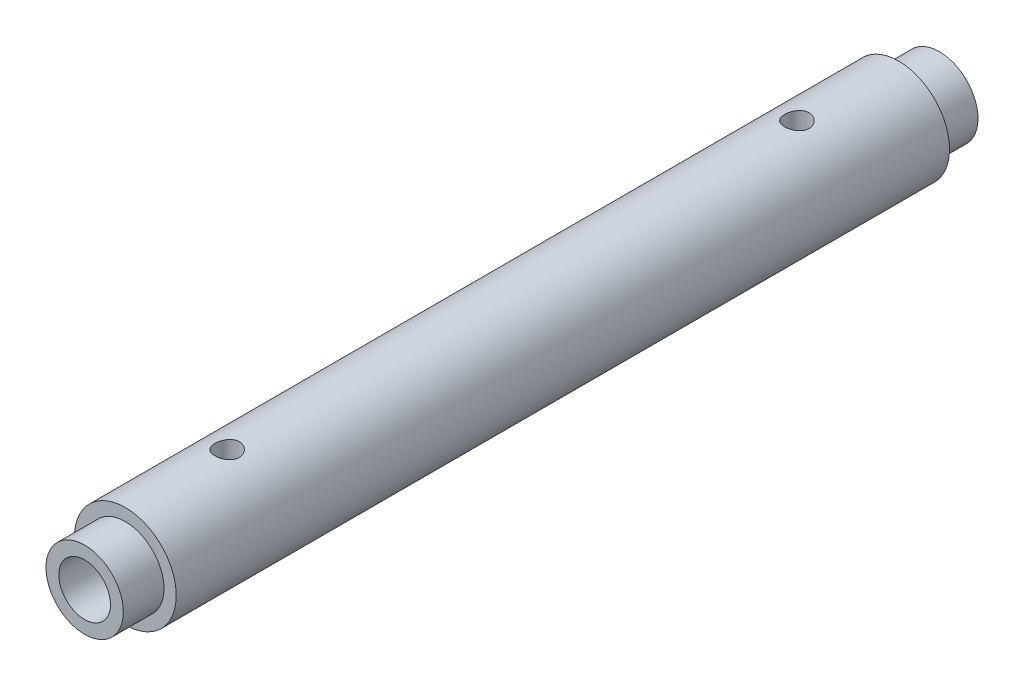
ISO-10303-21;
HEADER;
FILE_DESCRIPTION(('STEP AP214'),'2;1');
FILE_NAME('part.step','',(''),(''),'','','');
FILE_SCHEMA(('AUTOMOTIVE_DESIGN { 1 0 10303 214 1 1 1 1 }'));
ENDSEC;
DATA;
#1=APPLICATION_CONTEXT('core data for automotive mechanical design processes');
#2=APPLICATION_PROTOCOL_DEFINITION('international standard','automotive_design',2000,#1);
#3=PRODUCT_CONTEXT('',#1,'mechanical');
#4=PRODUCT('Part','Part','',(#3));
#5=PRODUCT_RELATED_PRODUCT_CATEGORY('part','',(#4));
#6=PRODUCT_DEFINITION_FORMATION('','',#4);
#7=PRODUCT_DEFINITION_CONTEXT('part definition',#1,'design');
#8=PRODUCT_DEFINITION('design','',#6,#7);
#9=PRODUCT_DEFINITION_SHAPE('','',#8);
#10=(LENGTH_UNIT() NAMED_UNIT(*) SI_UNIT(.MILLI.,.METRE.));
#11=(NAMED_UNIT(*) PLANE_ANGLE_UNIT() SI_UNIT($,.RADIAN.));
#12=(NAMED_UNIT(*) SI_UNIT($,.STERADIAN.) SOLID_ANGLE_UNIT());
#13=UNCERTAINTY_MEASURE_WITH_UNIT(LENGTH_MEASURE(1.E-05),#10,'distance_accuracy_value','');
#14=(GEOMETRIC_REPRESENTATION_CONTEXT(3) GLOBAL_UNCERTAINTY_ASSIGNED_CONTEXT((#13)) GLOBAL_UNIT_ASSIGNED_CONTEXT((#10,
#11,#12)) REPRESENTATION_CONTEXT('',''));
#15=CARTESIAN_POINT('',(0.,0.,0.));
#16=DIRECTION('',(0.,0.,1.));
#17=DIRECTION('',(1.,0.,0.));
#18=AXIS2_PLACEMENT_3D('',#15,#16,#17);
#19=CARTESIAN_POINT('',(0.,0.,0.));
#20=DIRECTION('',(0.,0.,1.));
#21=DIRECTION('',(0.,-1.,0.));
#22=AXIS2_PLACEMENT_3D('',#19,#20,#21);
#23=PLANE('',#22);
#24=CARTESIAN_POINT('',(0.,0.,0.));
#25=DIRECTION('',(0.,0.,-1.));
#26=DIRECTION('',(0.,1.,0.));
#27=AXIS2_PLACEMENT_3D('',#24,#25,#26);
#28=CIRCLE('',#27,6.35);
#29=CARTESIAN_POINT('',(0.,6.35,0.));
#30=VERTEX_POINT('',#29);
#31=EDGE_CURVE('E10',#30,#30,#28,.T.);
#32=ORIENTED_EDGE('',*,*,#31,.F.);
#33=EDGE_LOOP('',(#32));
#34=FACE_BOUND('',#33,.T.);
#35=ADVANCED_FACE('F29',(#34),#23,.T.);
#36=CARTESIAN_POINT('',(0.,0.,-110.));
#37=DIRECTION('',(0.,0.,-1.));
#38=DIRECTION('',(0.,1.,0.));
#39=AXIS2_PLACEMENT_3D('',#36,#37,#38);
#40=CYLINDRICAL_SURFACE('',#39,6.34999999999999);
#41=CARTESIAN_POINT('',(0.,6.35,18.));
#42=CARTESIAN_POINT('',(-0.158735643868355,6.34999131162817,17.9999895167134));
#43=CARTESIAN_POINT('',(-0.317696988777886,6.34398210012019,17.9873262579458));
#44=CARTESIAN_POINT('',(-0.630982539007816,6.32053556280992,17.9371996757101));
#45=CARTESIAN_POINT('',(-0.785295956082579,6.30307351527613,17.8996827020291));
#46=CARTESIAN_POINT('',(-1.0842690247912,6.25856360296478,17.8016090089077));
#47=CARTESIAN_POINT('',(-1.22896239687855,6.23155157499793,17.7411383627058));
#48=CARTESIAN_POINT('',(-1.50596538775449,6.17047124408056,17.5992895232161));
#49=CARTESIAN_POINT('',(-1.63827688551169,6.1364040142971,17.5179145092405));
#50=CARTESIAN_POINT('',(-1.89506470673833,6.06218401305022,17.3313710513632));
#51=CARTESIAN_POINT('',(-2.0186935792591,6.02179791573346,17.2251294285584));
#52=CARTESIAN_POINT('',(-2.24713450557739,5.94033863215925,16.9941964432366));
#53=CARTESIAN_POINT('',(-2.35193384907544,5.8992650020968,16.8694927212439));
#54=CARTESIAN_POINT('',(-2.54682621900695,5.81791039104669,16.5949351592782));
#55=CARTESIAN_POINT('',(-2.63545600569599,5.77786853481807,16.4439538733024));
#56=CARTESIAN_POINT('',(-2.74809115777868,5.72470256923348,16.2065236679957));
#57=CARTESIAN_POINT('',(-2.78225974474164,5.70812542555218,16.1255234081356));
#58=CARTESIAN_POINT('',(-2.84348823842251,5.67787297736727,15.9603719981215));
#59=CARTESIAN_POINT('',(-2.87055214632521,5.66419604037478,15.8762226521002));
#60=CARTESIAN_POINT('',(-2.9159220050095,5.6409673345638,15.7102013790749));
#61=CARTESIAN_POINT('',(-2.93463412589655,5.63122717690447,15.6284665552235));
#62=CARTESIAN_POINT('',(-2.96517735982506,5.6152044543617,15.4634237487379));
#63=CARTESIAN_POINT('',(-2.9770119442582,5.60892014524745,15.3801165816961));
#64=CARTESIAN_POINT('',(-2.99363646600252,5.60006542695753,15.2126376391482));
#65=CARTESIAN_POINT('',(-2.99842966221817,5.59749329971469,15.1284662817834));
#66=CARTESIAN_POINT('',(-3.00091788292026,5.59615798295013,14.9600155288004));
#67=CARTESIAN_POINT('',(-2.99861346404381,5.59739449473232,14.8757361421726));
#68=CARTESIAN_POINT('',(-2.98228707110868,5.60612787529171,14.6413526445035));
#69=CARTESIAN_POINT('',(-2.96044454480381,5.61779971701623,14.4918613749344));
#70=CARTESIAN_POINT('',(-2.89501216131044,5.6517888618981,14.19908293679));
#71=CARTESIAN_POINT('',(-2.85141651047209,5.67410900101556,14.0557974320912));
#72=CARTESIAN_POINT('',(-2.74288007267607,5.72737541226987,13.7753647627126));
#73=CARTESIAN_POINT('',(-2.67746822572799,5.758509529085,13.6384366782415));
#74=CARTESIAN_POINT('',(-2.52750090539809,5.82588930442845,13.3768863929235));
#75=CARTESIAN_POINT('',(-2.44293700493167,5.86213721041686,13.2522696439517));
#76=CARTESIAN_POINT('',(-2.24603652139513,5.94055944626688,13.0042286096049));
#77=CARTESIAN_POINT('',(-2.13165370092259,5.98294371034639,12.8824894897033));
#78=CARTESIAN_POINT('',(-1.88382332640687,6.06553935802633,12.6592659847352));
#79=CARTESIAN_POINT('',(-1.75036848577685,6.10574990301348,12.5577893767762));
#80=CARTESIAN_POINT('',(-1.46180089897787,6.1813162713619,12.3744689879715));
#81=CARTESIAN_POINT('',(-1.30606552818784,6.21643476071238,12.2934997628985));
#82=CARTESIAN_POINT('',(-0.981099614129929,6.27591792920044,12.1595302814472));
#83=CARTESIAN_POINT('',(-0.811878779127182,6.30029026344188,12.1065101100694));
#84=CARTESIAN_POINT('',(-0.478650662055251,6.33397698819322,12.0339065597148));
#85=CARTESIAN_POINT('',(-0.315236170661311,6.34430139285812,12.0120739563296));
#86=CARTESIAN_POINT('',(0.0132401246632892,6.35210748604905,11.9955309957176));
#87=CARTESIAN_POINT('',(0.178301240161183,6.34959433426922,12.0008097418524));
#88=CARTESIAN_POINT('',(0.493581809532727,6.33262500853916,12.036917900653));
#89=CARTESIAN_POINT('',(0.644051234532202,6.31898607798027,12.0659993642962));
#90=CARTESIAN_POINT('',(0.937719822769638,6.28212499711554,12.1462549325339));
#91=CARTESIAN_POINT('',(1.08091814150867,6.25890173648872,12.1974315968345));
#92=CARTESIAN_POINT('',(1.36096532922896,6.20413258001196,12.3219455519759));
#93=CARTESIAN_POINT('',(1.49748886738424,6.17235515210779,12.3959091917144));
#94=CARTESIAN_POINT('',(1.75666682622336,6.103656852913,12.5632108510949));
#95=CARTESIAN_POINT('',(1.87931512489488,6.06673372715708,12.6565573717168));
#96=CARTESIAN_POINT('',(2.11888943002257,5.98749695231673,12.8696803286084));
#97=CARTESIAN_POINT('',(2.23431643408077,5.94499681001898,12.9910760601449));
#98=CARTESIAN_POINT('',(2.44375164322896,5.86202140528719,13.2518400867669));
#99=CARTESIAN_POINT('',(2.53774887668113,5.82154718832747,13.3912175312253));
#100=CARTESIAN_POINT('',(2.70463547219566,5.74596844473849,13.69031721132));
#101=CARTESIAN_POINT('',(2.77667149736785,5.71110126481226,13.8505805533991));
#102=CARTESIAN_POINT('',(2.89199593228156,5.65359008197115,14.1831514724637));
#103=CARTESIAN_POINT('',(2.93531709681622,5.63093215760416,14.3554450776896));
#104=CARTESIAN_POINT('',(2.98833110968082,5.60296296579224,14.690273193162));
#105=CARTESIAN_POINT('',(3.0007349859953,5.59625585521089,14.8522609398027));
#106=CARTESIAN_POINT('',(2.99919821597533,5.5970815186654,15.1760513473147));
#107=CARTESIAN_POINT('',(2.98526553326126,5.60460998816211,15.3378540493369));
#108=CARTESIAN_POINT('',(2.93391097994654,5.63164218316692,15.6437237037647));
#109=CARTESIAN_POINT('',(2.8983673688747,5.65018584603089,15.788200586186));
#110=CARTESIAN_POINT('',(2.80694513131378,5.69615317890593,16.0690579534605));
#111=CARTESIAN_POINT('',(2.75106038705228,5.72357952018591,16.2054359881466));
#112=CARTESIAN_POINT('',(2.61632375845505,5.78646860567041,16.476220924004));
#113=CARTESIAN_POINT('',(2.53618984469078,5.8223450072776,16.609891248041));
#114=CARTESIAN_POINT('',(2.35675969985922,5.89725587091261,16.8627222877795));
#115=CARTESIAN_POINT('',(2.25745430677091,5.93629183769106,16.9818760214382));
#116=CARTESIAN_POINT('',(2.03038590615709,6.01797799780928,17.215109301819));
#117=CARTESIAN_POINT('',(1.90073846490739,6.06058247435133,17.3273764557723));
#118=CARTESIAN_POINT('',(1.62298549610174,6.14078504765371,17.5288946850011));
#119=CARTESIAN_POINT('',(1.47487109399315,6.17838071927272,17.6181346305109));
#120=CARTESIAN_POINT('',(1.24202481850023,6.22785646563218,17.7321870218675));
#121=CARTESIAN_POINT('',(1.16272476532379,6.24318215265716,17.7668755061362));
#122=CARTESIAN_POINT('',(1.00102034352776,6.27113792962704,17.8293917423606));
#123=CARTESIAN_POINT('',(0.918617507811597,6.283769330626,17.8572228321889));
#124=CARTESIAN_POINT('',(0.751519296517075,6.30593452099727,17.9056447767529));
#125=CARTESIAN_POINT('',(0.666829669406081,6.31547541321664,17.9262522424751));
#126=CARTESIAN_POINT('',(0.49571823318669,6.33120329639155,17.9600439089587));
#127=CARTESIAN_POINT('',(0.409297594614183,6.33739247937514,17.9732329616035));
#128=CARTESIAN_POINT('',(0.268909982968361,6.34452974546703,17.9884080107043));
#129=CARTESIAN_POINT('',(0.215242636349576,6.34657804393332,17.9927517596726));
#130=CARTESIAN_POINT('',(0.107725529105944,6.34931466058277,17.9985495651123));
#131=CARTESIAN_POINT('',(0.0538757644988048,6.35000294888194,18.0000035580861));
#132=CARTESIAN_POINT('',(0.,6.35,18.));
#133=B_SPLINE_CURVE_WITH_KNOTS('',3,(#41,#42,#43,#44,#45,#46,#47,#48,#49,#50,#51,#52,#53,#54,
#55,#56,#57,#58,#59,#60,#61,#62,#63,#64,#65,#66,#67,#68,#69,#70,#71,#72,#73,#74,#75,#76,#77,#78,
#79,#80,#81,#82,#83,#84,#85,#86,#87,#88,#89,#90,#91,#92,#93,#94,#95,#96,#97,#98,#99,#100,#101,
#102,#103,#104,#105,#106,#107,#108,#109,#110,#111,#112,#113,#114,#115,#116,#117,#118,#119,#120,
#121,#122,#123,#124,#125,#126,#127,#128,#129,#130,#131,#132),.UNSPECIFIED.,.T.,.F.,(4,2,2,2,2,2,
2,2,2,2,2,2,2,2,2,2,2,2,2,2,2,2,2,2,2,2,2,2,2,2,2,2,2,2,2,2,2,2,2,2,2,2,2,2,2,4),(0.,
0.475997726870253,0.953026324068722,1.42828352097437,1.90346847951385,2.40513253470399,
2.90713396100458,3.44289983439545,3.71097177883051,3.97889242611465,4.23178157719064,
4.48454297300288,4.73718734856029,4.98981191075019,5.44206841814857,5.89444544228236,
6.35730164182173,6.82036189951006,7.33510031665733,7.85003592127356,8.38419883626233,
8.91798061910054,9.41089442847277,9.9036101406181,10.3630820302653,10.8226071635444,
11.2961009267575,11.7698027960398,12.2859764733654,12.8024138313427,13.336915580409,
13.8708065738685,14.3559144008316,14.8408755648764,15.2887410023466,15.7367412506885,
16.2145869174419,16.6926615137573,17.2203903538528,17.7483737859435,18.0117778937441,
18.2750535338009,18.5377197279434,18.8002139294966,18.9617666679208,19.1233229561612),.UNSPECIFIED.);
#134=CARTESIAN_POINT('',(0.,6.35,18.));
#135=VERTEX_POINT('',#134);
#136=EDGE_CURVE('E83',#135,#135,#133,.T.);
#137=ORIENTED_EDGE('',*,*,#136,.F.);
#138=EDGE_LOOP('',(#137));
#139=FACE_BOUND('',#138,.T.);
#140=CARTESIAN_POINT('',(0.,-6.34999999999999,18.));
#141=CARTESIAN_POINT('',(0.158735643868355,-6.34999131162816,17.9999895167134));
#142=CARTESIAN_POINT('',(0.317696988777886,-6.34398210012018,17.9873262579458));
#143=CARTESIAN_POINT('',(0.630982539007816,-6.32053556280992,17.9371996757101));
#144=CARTESIAN_POINT('',(0.785295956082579,-6.30307351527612,17.8996827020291));
#145=CARTESIAN_POINT('',(1.0842690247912,-6.25856360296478,17.8016090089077));
#146=CARTESIAN_POINT('',(1.22896239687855,-6.23155157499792,17.7411383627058));
#147=CARTESIAN_POINT('',(1.50596538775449,-6.17047124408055,17.5992895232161));
#148=CARTESIAN_POINT('',(1.63827688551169,-6.13640401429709,17.5179145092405));
#149=CARTESIAN_POINT('',(1.89506470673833,-6.06218401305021,17.3313710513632));
#150=CARTESIAN_POINT('',(2.0186935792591,-6.02179791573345,17.2251294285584));
#151=CARTESIAN_POINT('',(2.24713450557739,-5.94033863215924,16.9941964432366));
#152=CARTESIAN_POINT('',(2.35193384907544,-5.89926500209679,16.8694927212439));
#153=CARTESIAN_POINT('',(2.54682621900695,-5.81791039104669,16.5949351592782));
#154=CARTESIAN_POINT('',(2.63545600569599,-5.77786853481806,16.4439538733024));
#155=CARTESIAN_POINT('',(2.74809115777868,-5.72470256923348,16.2065236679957));
#156=CARTESIAN_POINT('',(2.78225974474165,-5.70812542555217,16.1255234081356));
#157=CARTESIAN_POINT('',(2.84348823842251,-5.67787297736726,15.9603719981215));
#158=CARTESIAN_POINT('',(2.87055214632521,-5.66419604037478,15.8762226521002));
#159=CARTESIAN_POINT('',(2.9159220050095,-5.6409673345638,15.7102013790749));
#160=CARTESIAN_POINT('',(2.93463412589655,-5.63122717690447,15.6284665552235));
#161=CARTESIAN_POINT('',(2.96517735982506,-5.6152044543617,15.4634237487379));
#162=CARTESIAN_POINT('',(2.9770119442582,-5.60892014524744,15.3801165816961));
#163=CARTESIAN_POINT('',(2.99363646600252,-5.60006542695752,15.2126376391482));
#164=CARTESIAN_POINT('',(2.99842966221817,-5.59749329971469,15.1284662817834));
#165=CARTESIAN_POINT('',(3.00091788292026,-5.59615798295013,14.9600155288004));
#166=CARTESIAN_POINT('',(2.99861346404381,-5.59739449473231,14.8757361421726));
#167=CARTESIAN_POINT('',(2.98228707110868,-5.60612787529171,14.6413526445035));
#168=CARTESIAN_POINT('',(2.96044454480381,-5.61779971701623,14.4918613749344));
#169=CARTESIAN_POINT('',(2.89501216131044,-5.65178886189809,14.19908293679));
#170=CARTESIAN_POINT('',(2.85141651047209,-5.67410900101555,14.0557974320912));
#171=CARTESIAN_POINT('',(2.74288007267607,-5.72737541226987,13.7753647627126));
#172=CARTESIAN_POINT('',(2.67746822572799,-5.75850952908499,13.6384366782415));
#173=CARTESIAN_POINT('',(2.52750090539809,-5.82588930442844,13.3768863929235));
#174=CARTESIAN_POINT('',(2.44293700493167,-5.86213721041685,13.2522696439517));
#175=CARTESIAN_POINT('',(2.24603652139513,-5.94055944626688,13.0042286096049));
#176=CARTESIAN_POINT('',(2.13165370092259,-5.98294371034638,12.8824894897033));
#177=CARTESIAN_POINT('',(1.88382332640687,-6.06553935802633,12.6592659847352));
#178=CARTESIAN_POINT('',(1.75036848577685,-6.10574990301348,12.5577893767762));
#179=CARTESIAN_POINT('',(1.46180089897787,-6.1813162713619,12.3744689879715));
#180=CARTESIAN_POINT('',(1.30606552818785,-6.21643476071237,12.2934997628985));
#181=CARTESIAN_POINT('',(0.981099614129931,-6.27591792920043,12.1595302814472));
#182=CARTESIAN_POINT('',(0.811878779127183,-6.30029026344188,12.1065101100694));
#183=CARTESIAN_POINT('',(0.478650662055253,-6.33397698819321,12.0339065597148));
#184=CARTESIAN_POINT('',(0.315236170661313,-6.34430139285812,12.0120739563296));
#185=CARTESIAN_POINT('',(-0.0132401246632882,-6.35210748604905,11.9955309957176));
#186=CARTESIAN_POINT('',(-0.178301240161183,-6.34959433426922,12.0008097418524));
#187=CARTESIAN_POINT('',(-0.493581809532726,-6.33262500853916,12.036917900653));
#188=CARTESIAN_POINT('',(-0.644051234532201,-6.31898607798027,12.0659993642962));
#189=CARTESIAN_POINT('',(-0.937719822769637,-6.28212499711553,12.1462549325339));
#190=CARTESIAN_POINT('',(-1.08091814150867,-6.25890173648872,12.1974315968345));
#191=CARTESIAN_POINT('',(-1.36096532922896,-6.20413258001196,12.3219455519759));
#192=CARTESIAN_POINT('',(-1.49748886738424,-6.17235515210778,12.3959091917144));
#193=CARTESIAN_POINT('',(-1.75666682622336,-6.103656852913,12.5632108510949));
#194=CARTESIAN_POINT('',(-1.87931512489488,-6.06673372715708,12.6565573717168));
#195=CARTESIAN_POINT('',(-2.11888943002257,-5.98749695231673,12.8696803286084));
#196=CARTESIAN_POINT('',(-2.23431643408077,-5.94499681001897,12.9910760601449));
#197=CARTESIAN_POINT('',(-2.44375164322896,-5.86202140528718,13.2518400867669));
#198=CARTESIAN_POINT('',(-2.53774887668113,-5.82154718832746,13.3912175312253));
#199=CARTESIAN_POINT('',(-2.70463547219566,-5.74596844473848,13.69031721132));
#200=CARTESIAN_POINT('',(-2.77667149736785,-5.71110126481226,13.8505805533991));
#201=CARTESIAN_POINT('',(-2.89199593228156,-5.65359008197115,14.1831514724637));
#202=CARTESIAN_POINT('',(-2.93531709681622,-5.63093215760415,14.3554450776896));
#203=CARTESIAN_POINT('',(-2.98833110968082,-5.60296296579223,14.690273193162));
#204=CARTESIAN_POINT('',(-3.0007349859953,-5.59625585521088,14.8522609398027));
#205=CARTESIAN_POINT('',(-2.99919821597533,-5.5970815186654,15.1760513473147));
#206=CARTESIAN_POINT('',(-2.98526553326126,-5.6046099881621,15.3378540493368));
#207=CARTESIAN_POINT('',(-2.93391097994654,-5.63164218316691,15.6437237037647));
#208=CARTESIAN_POINT('',(-2.8983673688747,-5.65018584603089,15.788200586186));
#209=CARTESIAN_POINT('',(-2.80694513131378,-5.69615317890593,16.0690579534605));
#210=CARTESIAN_POINT('',(-2.75106038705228,-5.7235795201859,16.2054359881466));
#211=CARTESIAN_POINT('',(-2.61632375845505,-5.78646860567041,16.476220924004));
#212=CARTESIAN_POINT('',(-2.53618984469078,-5.82234500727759,16.609891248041));
#213=CARTESIAN_POINT('',(-2.35675969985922,-5.89725587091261,16.8627222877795));
#214=CARTESIAN_POINT('',(-2.25745430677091,-5.93629183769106,16.9818760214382));
#215=CARTESIAN_POINT('',(-2.03038590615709,-6.01797799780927,17.215109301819));
#216=CARTESIAN_POINT('',(-1.90073846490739,-6.06058247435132,17.3273764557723));
#217=CARTESIAN_POINT('',(-1.62298549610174,-6.14078504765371,17.5288946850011));
#218=CARTESIAN_POINT('',(-1.47487109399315,-6.17838071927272,17.6181346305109));
#219=CARTESIAN_POINT('',(-1.24202481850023,-6.22785646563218,17.7321870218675));
#220=CARTESIAN_POINT('',(-1.16272476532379,-6.24318215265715,17.7668755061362));
#221=CARTESIAN_POINT('',(-1.00102034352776,-6.27113792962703,17.8293917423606));
#222=CARTESIAN_POINT('',(-0.918617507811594,-6.28376933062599,17.8572228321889));
#223=CARTESIAN_POINT('',(-0.751519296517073,-6.30593452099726,17.9056447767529));
#224=CARTESIAN_POINT('',(-0.66682966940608,-6.31547541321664,17.9262522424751));
#225=CARTESIAN_POINT('',(-0.49571823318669,-6.33120329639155,17.9600439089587));
#226=CARTESIAN_POINT('',(-0.409297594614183,-6.33739247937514,17.9732329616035));
#227=CARTESIAN_POINT('',(-0.268909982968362,-6.34452974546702,17.9884080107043));
#228=CARTESIAN_POINT('',(-0.215242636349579,-6.34657804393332,17.9927517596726));
#229=CARTESIAN_POINT('',(-0.107725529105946,-6.34931466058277,17.9985495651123));
#230=CARTESIAN_POINT('',(-0.053875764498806,-6.35000294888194,18.0000035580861));
#231=CARTESIAN_POINT('',(0.,-6.34999999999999,18.));
#232=B_SPLINE_CURVE_WITH_KNOTS('',3,(#140,#141,#142,#143,#144,#145,#146,#147,#148,#149,#150,
#151,#152,#153,#154,#155,#156,#157,#158,#159,#160,#161,#162,#163,#164,#165,#166,#167,#168,#169,
#170,#171,#172,#173,#174,#175,#176,#177,#178,#179,#180,#181,#182,#183,#184,#185,#186,#187,#188,
#189,#190,#191,#192,#193,#194,#195,#196,#197,#198,#199,#200,#201,#202,#203,#204,#205,#206,#207,
#208,#209,#210,#211,#212,#213,#214,#215,#216,#217,#218,#219,#220,#221,#222,#223,#224,#225,#226,
#227,#228,#229,#230,#231),.UNSPECIFIED.,.T.,.F.,(4,2,2,2,2,2,2,2,2,2,2,2,2,2,2,2,2,2,2,2,2,2,2,
2,2,2,2,2,2,2,2,2,2,2,2,2,2,2,2,2,2,2,2,2,2,4),(0.,0.475997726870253,0.953026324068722,
1.42828352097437,1.90346847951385,2.40513253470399,2.90713396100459,3.44289983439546,
3.71097177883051,3.97889242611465,4.23178157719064,4.48454297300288,4.73718734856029,
4.98981191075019,5.44206841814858,5.89444544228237,6.35730164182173,6.82036189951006,
7.33510031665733,7.85003592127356,8.38419883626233,8.91798061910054,9.41089442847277,
9.9036101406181,10.3630820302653,10.8226071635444,11.2961009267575,11.7698027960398,
12.2859764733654,12.8024138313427,13.336915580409,13.8708065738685,14.3559144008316,
14.8408755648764,15.2887410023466,15.7367412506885,16.2145869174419,16.6926615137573,
17.2203903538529,17.7483737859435,18.0117778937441,18.275053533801,18.5377197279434,
18.8002139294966,18.9617666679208,19.1233229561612),.UNSPECIFIED.);
#233=CARTESIAN_POINT('',(0.,-6.34999999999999,18.));
#234=VERTEX_POINT('',#233);
#235=EDGE_CURVE('E78',#234,#234,#232,.T.);
#236=ORIENTED_EDGE('',*,*,#235,.F.);
#237=EDGE_LOOP('',(#236));
#238=FACE_BOUND('',#237,.T.);
#239=ORIENTED_EDGE('',*,*,#31,.T.);
#240=EDGE_LOOP('',(#239));
#241=FACE_BOUND('',#240,.T.);
#242=CARTESIAN_POINT('',(0.,0.,50.));
#243=DIRECTION('',(0.,0.,-1.));
#244=DIRECTION('',(0.,1.,0.));
#245=AXIS2_PLACEMENT_3D('',#242,#243,#244);
#246=CIRCLE('',#245,6.34999999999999);
#247=CARTESIAN_POINT('',(0.,6.34999999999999,50.));
#248=VERTEX_POINT('',#247);
#249=EDGE_CURVE('E40',#248,#248,#246,.T.);
#250=ORIENTED_EDGE('',*,*,#249,.F.);
#251=EDGE_LOOP('',(#250));
#252=FACE_BOUND('',#251,.T.);
#253=ADVANCED_FACE('F90',(#139,#238,#241,#252),#40,.F.);
#254=CARTESIAN_POINT('',(0.,6.34999999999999,50.));
#255=DIRECTION('',(0.,0.,1.));
#256=DIRECTION('',(0.,-1.,0.));
#257=AXIS2_PLACEMENT_3D('',#254,#255,#256);
#258=PLANE('',#257);
#259=ORIENTED_EDGE('',*,*,#249,.T.);
#260=EDGE_LOOP('',(#259));
#261=FACE_BOUND('',#260,.T.);
#262=CARTESIAN_POINT('',(0.,0.,50.));
#263=DIRECTION('',(0.,0.,-1.));
#264=DIRECTION('',(0.,1.,0.));
#265=AXIS2_PLACEMENT_3D('',#262,#263,#264);
#266=CIRCLE('',#265,9.49999999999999);
#267=CARTESIAN_POINT('',(0.,9.5,50.));
#268=VERTEX_POINT('',#267);
#269=EDGE_CURVE('E45',#268,#268,#266,.T.);
#270=ORIENTED_EDGE('',*,*,#269,.F.);
#271=EDGE_LOOP('',(#270));
#272=FACE_BOUND('',#271,.T.);
#273=ADVANCED_FACE('F94',(#261,#272),#258,.T.);
#274=CARTESIAN_POINT('',(0.,0.,-110.));
#275=DIRECTION('',(0.,0.,-1.));
#276=DIRECTION('',(0.,1.,0.));
#277=AXIS2_PLACEMENT_3D('',#274,#275,#276);
#278=CYLINDRICAL_SURFACE('',#277,9.49999999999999);
#279=ORIENTED_EDGE('',*,*,#269,.T.);
#280=EDGE_LOOP('',(#279));
#281=FACE_BOUND('',#280,.T.);
#282=CARTESIAN_POINT('',(0.,0.,40.));
#283=DIRECTION('',(0.,0.,-1.));
#284=DIRECTION('',(0.,1.,0.));
#285=AXIS2_PLACEMENT_3D('',#282,#283,#284);
#286=CIRCLE('',#285,9.49999999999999);
#287=CARTESIAN_POINT('',(0.,9.5,40.));
#288=VERTEX_POINT('',#287);
#289=EDGE_CURVE('E251',#288,#288,#286,.T.);
#290=ORIENTED_EDGE('',*,*,#289,.F.);
#291=EDGE_LOOP('',(#290));
#292=FACE_BOUND('',#291,.T.);
#293=ADVANCED_FACE('F99',(#281,#292),#278,.T.);
#294=CARTESIAN_POINT('',(0.,9.5,40.));
#295=DIRECTION('',(0.,0.,1.));
#296=DIRECTION('',(0.,-1.,0.));
#297=AXIS2_PLACEMENT_3D('',#294,#295,#296);
#298=PLANE('',#297);
#299=ORIENTED_EDGE('',*,*,#289,.T.);
#300=EDGE_LOOP('',(#299));
#301=FACE_BOUND('',#300,.T.);
#302=CARTESIAN_POINT('',(0.,0.,40.));
#303=DIRECTION('',(0.,0.,-1.));
#304=DIRECTION('',(0.,1.,0.));
#305=AXIS2_PLACEMENT_3D('',#302,#303,#304);
#306=CIRCLE('',#305,12.5);
#307=CARTESIAN_POINT('',(0.,12.5,40.));
#308=VERTEX_POINT('',#307);
#309=EDGE_CURVE('E248',#308,#308,#306,.T.);
#310=ORIENTED_EDGE('',*,*,#309,.F.);
#311=EDGE_LOOP('',(#310));
#312=FACE_BOUND('',#311,.T.);
#313=ADVANCED_FACE('F102',(#301,#312),#298,.T.);
#314=CARTESIAN_POINT('',(0.,0.,-110.));
#315=DIRECTION('',(0.,0.,-1.));
#316=DIRECTION('',(0.,1.,0.));
#317=AXIS2_PLACEMENT_3D('',#314,#315,#316);
#318=CYLINDRICAL_SURFACE('',#317,12.5);
#319=CARTESIAN_POINT('',(0.,12.5,-122.));
#320=CARTESIAN_POINT('',(0.165963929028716,12.4999970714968,-122.000005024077));
#321=CARTESIAN_POINT('',(0.331985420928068,12.4966615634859,-122.013818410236));
#322=CARTESIAN_POINT('',(0.659284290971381,12.4836783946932,-122.068632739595));
#323=CARTESIAN_POINT('',(0.820558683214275,12.4740268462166,-122.109650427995));
#324=CARTESIAN_POINT('',(1.13358839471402,12.4494823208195,-122.217492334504));
#325=CARTESIAN_POINT('',(1.28535442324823,12.4345953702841,-122.284286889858));
#326=CARTESIAN_POINT('',(1.57552517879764,12.4011725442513,-122.441685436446));
#327=CARTESIAN_POINT('',(1.71392971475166,12.3826366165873,-122.532289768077));
#328=CARTESIAN_POINT('',(1.97609263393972,12.3435386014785,-122.736564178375));
#329=CARTESIAN_POINT('',(2.0995595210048,12.322947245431,-122.850602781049));
#330=CARTESIAN_POINT('',(2.32581080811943,12.2822574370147,-123.097718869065));
#331=CARTESIAN_POINT('',(2.42859304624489,12.2621590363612,-123.230798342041));
#332=CARTESIAN_POINT('',(2.61189993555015,12.224437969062,-123.514445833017));
#333=CARTESIAN_POINT('',(2.69210377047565,12.2068525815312,-123.665226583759));
#334=CARTESIAN_POINT('',(2.82591582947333,12.1765733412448,-123.978619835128));
#335=CARTESIAN_POINT('',(2.87952794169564,12.1638787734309,-124.141230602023));
#336=CARTESIAN_POINT('',(2.95765058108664,12.1451184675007,-124.470476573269));
#337=CARTESIAN_POINT('',(2.98268262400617,12.1389341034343,-124.636981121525));
#338=CARTESIAN_POINT('',(3.00455808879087,12.1335389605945,-124.971932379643));
#339=CARTESIAN_POINT('',(3.00140571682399,12.1343271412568,-125.140378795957));
#340=CARTESIAN_POINT('',(2.96741912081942,12.1426811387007,-125.470475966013));
#341=CARTESIAN_POINT('',(2.93720103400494,12.1500960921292,-125.63219456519));
#342=CARTESIAN_POINT('',(2.85092141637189,12.1706283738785,-125.948197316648));
#343=CARTESIAN_POINT('',(2.79485817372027,12.1837460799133,-126.102480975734));
#344=CARTESIAN_POINT('',(2.65794121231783,12.2143476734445,-126.400912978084));
#345=CARTESIAN_POINT('',(2.57685948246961,12.2318714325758,-126.544952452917));
#346=CARTESIAN_POINT('',(2.39236688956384,12.2692875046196,-126.817604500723));
#347=CARTESIAN_POINT('',(2.28895240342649,12.2891802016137,-126.946214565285));
#348=CARTESIAN_POINT('',(2.05951493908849,12.329732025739,-127.187893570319));
#349=CARTESIAN_POINT('',(1.9329706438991,12.3503975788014,-127.300467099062));
#350=CARTESIAN_POINT('',(1.66255592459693,12.3896951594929,-127.502884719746));
#351=CARTESIAN_POINT('',(1.51868504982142,12.4083271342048,-127.592728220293));
#352=CARTESIAN_POINT('',(1.21702847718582,12.4415394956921,-127.747297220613));
#353=CARTESIAN_POINT('',(1.05920278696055,12.4561077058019,-127.811947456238));
#354=CARTESIAN_POINT('',(0.734497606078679,12.4794620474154,-127.913665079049));
#355=CARTESIAN_POINT('',(0.567619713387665,12.4882491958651,-127.950737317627));
#356=CARTESIAN_POINT('',(0.233787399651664,12.4989027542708,-127.995502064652));
#357=CARTESIAN_POINT('',(0.0669284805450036,12.5009282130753,-128.003869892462));
#358=CARTESIAN_POINT('',(-0.265804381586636,12.4982807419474,-127.992833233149));
#359=CARTESIAN_POINT('',(-0.431678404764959,12.4936083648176,-127.973431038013));
#360=CARTESIAN_POINT('',(-0.755422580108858,12.4781916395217,-127.907963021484));
#361=CARTESIAN_POINT('',(-0.91337057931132,12.4675301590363,-127.862260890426));
#362=CARTESIAN_POINT('',(-1.21935330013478,12.4413335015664,-127.745901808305));
#363=CARTESIAN_POINT('',(-1.36738706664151,12.4257978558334,-127.675242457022));
#364=CARTESIAN_POINT('',(-1.6520615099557,12.3911910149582,-127.509633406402));
#365=CARTESIAN_POINT('',(-1.78847176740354,12.3720653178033,-127.414299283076));
#366=CARTESIAN_POINT('',(-2.04359904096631,12.3324936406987,-127.202543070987));
#367=CARTESIAN_POINT('',(-2.16231325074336,12.3120474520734,-127.086117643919));
#368=CARTESIAN_POINT('',(-2.38142453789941,12.271574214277,-126.832359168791));
#369=CARTESIAN_POINT('',(-2.48134974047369,12.2515669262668,-126.694614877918));
#370=CARTESIAN_POINT('',(-2.65666020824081,12.2147538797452,-126.403909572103));
#371=CARTESIAN_POINT('',(-2.7320465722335,12.1979479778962,-126.250949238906));
#372=CARTESIAN_POINT('',(-2.85558993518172,12.1696189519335,-125.934987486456));
#373=CARTESIAN_POINT('',(-2.90390754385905,12.1580647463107,-125.772051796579));
#374=CARTESIAN_POINT('',(-2.97238380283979,12.1415072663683,-125.440053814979));
#375=CARTESIAN_POINT('',(-2.99254804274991,12.1365026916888,-125.270992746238));
#376=CARTESIAN_POINT('',(-3.00387066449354,12.1337046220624,-124.936329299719));
#377=CARTESIAN_POINT('',(-2.99578106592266,12.1357241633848,-124.770753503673));
#378=CARTESIAN_POINT('',(-2.95253345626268,12.1463176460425,-124.443400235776));
#379=CARTESIAN_POINT('',(-2.91737590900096,12.1548914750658,-124.281622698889));
#380=CARTESIAN_POINT('',(-2.82138591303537,12.1775274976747,-123.967202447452));
#381=CARTESIAN_POINT('',(-2.76068402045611,12.191561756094,-123.814517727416));
#382=CARTESIAN_POINT('',(-2.61543373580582,12.2235433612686,-123.521395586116));
#383=CARTESIAN_POINT('',(-2.53088229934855,12.2414912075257,-123.380959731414));
#384=CARTESIAN_POINT('',(-2.33793007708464,12.279819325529,-123.11266299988));
#385=CARTESIAN_POINT('',(-2.22900267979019,12.3002478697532,-122.985187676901));
#386=CARTESIAN_POINT('',(-1.99143074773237,12.3409359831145,-122.750080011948));
#387=CARTESIAN_POINT('',(-1.86278158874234,12.361195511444,-122.64245233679));
#388=CARTESIAN_POINT('',(-1.5868829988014,12.3996570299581,-122.448390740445));
#389=CARTESIAN_POINT('',(-1.43936414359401,12.4178200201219,-122.362331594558));
#390=CARTESIAN_POINT('',(-1.13153622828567,12.4496380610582,-122.216370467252));
#391=CARTESIAN_POINT('',(-0.971236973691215,12.4632965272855,-122.156448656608));
#392=CARTESIAN_POINT('',(-0.675887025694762,12.4824059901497,-122.073961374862));
#393=CARTESIAN_POINT('',(-0.542312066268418,12.4889599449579,-122.046283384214));
#394=CARTESIAN_POINT('',(-0.272504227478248,12.4977580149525,-122.009301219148));
#395=CARTESIAN_POINT('',(-0.136271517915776,12.5000024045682,-121.999995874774));
#396=CARTESIAN_POINT('',(0.,12.5,-122.));
#397=B_SPLINE_CURVE_WITH_KNOTS('',3,(#319,#320,#321,#322,#323,#324,#325,#326,#327,#328,#329,
#330,#331,#332,#333,#334,#335,#336,#337,#338,#339,#340,#341,#342,#343,#344,#345,#346,#347,#348,
#349,#350,#351,#352,#353,#354,#355,#356,#357,#358,#359,#360,#361,#362,#363,#364,#365,#366,#367,
#368,#369,#370,#371,#372,#373,#374,#375,#376,#377,#378,#379,#380,#381,#382,#383,#384,#385,#386,
#387,#388,#389,#390,#391,#392,#393,#394,#395,#396),.UNSPECIFIED.,.T.,.F.,(4,2,2,2,2,2,2,2,2,2,2,
2,2,2,2,2,2,2,2,2,2,2,2,2,2,2,2,2,2,2,2,2,2,2,2,2,2,2,4),(0.,0.497392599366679,
0.995091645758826,1.49221966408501,1.9893547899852,2.49500570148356,3.00070943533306,
3.51327262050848,4.02576083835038,4.52873995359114,5.03164400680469,5.52338274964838,
6.01515406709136,6.51154667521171,7.00801987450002,7.51749958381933,8.0269925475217,
8.53799614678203,9.04890983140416,9.54771776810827,10.0464845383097,10.5385143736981,
11.0305915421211,11.5308523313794,12.031192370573,12.5427824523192,13.0543496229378,
13.5628484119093,14.0712462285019,14.5662165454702,15.0611783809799,15.5536406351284,
16.0461657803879,16.5505844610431,17.055121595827,17.5678974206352,18.0802835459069,
18.4887142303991,18.897118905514),.UNSPECIFIED.);
#398=CARTESIAN_POINT('',(0.,12.5,-122.));
#399=VERTEX_POINT('',#398);
#400=EDGE_CURVE('E57',#399,#399,#397,.T.);
#401=ORIENTED_EDGE('',*,*,#400,.F.);
#402=EDGE_LOOP('',(#401));
#403=FACE_BOUND('',#402,.T.);
#404=CARTESIAN_POINT('',(0.,-12.5,-122.));
#405=CARTESIAN_POINT('',(-0.165963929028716,-12.4999970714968,-122.000005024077));
#406=CARTESIAN_POINT('',(-0.331985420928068,-12.4966615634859,-122.013818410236));
#407=CARTESIAN_POINT('',(-0.659284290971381,-12.4836783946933,-122.068632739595));
#408=CARTESIAN_POINT('',(-0.820558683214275,-12.4740268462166,-122.109650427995));
#409=CARTESIAN_POINT('',(-1.13358839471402,-12.4494823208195,-122.217492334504));
#410=CARTESIAN_POINT('',(-1.28535442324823,-12.4345953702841,-122.284286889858));
#411=CARTESIAN_POINT('',(-1.57552517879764,-12.4011725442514,-122.441685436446));
#412=CARTESIAN_POINT('',(-1.71392971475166,-12.3826366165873,-122.532289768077));
#413=CARTESIAN_POINT('',(-1.97609263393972,-12.3435386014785,-122.736564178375));
#414=CARTESIAN_POINT('',(-2.0995595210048,-12.3229472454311,-122.850602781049));
#415=CARTESIAN_POINT('',(-2.32581080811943,-12.2822574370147,-123.097718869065));
#416=CARTESIAN_POINT('',(-2.42859304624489,-12.2621590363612,-123.230798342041));
#417=CARTESIAN_POINT('',(-2.61189993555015,-12.224437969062,-123.514445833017));
#418=CARTESIAN_POINT('',(-2.69210377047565,-12.2068525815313,-123.665226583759));
#419=CARTESIAN_POINT('',(-2.82591582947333,-12.1765733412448,-123.978619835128));
#420=CARTESIAN_POINT('',(-2.87952794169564,-12.1638787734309,-124.141230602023));
#421=CARTESIAN_POINT('',(-2.95765058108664,-12.1451184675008,-124.470476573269));
#422=CARTESIAN_POINT('',(-2.98268262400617,-12.1389341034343,-124.636981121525));
#423=CARTESIAN_POINT('',(-3.00455808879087,-12.1335389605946,-124.971932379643));
#424=CARTESIAN_POINT('',(-3.00140571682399,-12.1343271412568,-125.140378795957));
#425=CARTESIAN_POINT('',(-2.96741912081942,-12.1426811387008,-125.470475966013));
#426=CARTESIAN_POINT('',(-2.93720103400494,-12.1500960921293,-125.63219456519));
#427=CARTESIAN_POINT('',(-2.85092141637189,-12.1706283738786,-125.948197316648));
#428=CARTESIAN_POINT('',(-2.79485817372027,-12.1837460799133,-126.102480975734));
#429=CARTESIAN_POINT('',(-2.65794121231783,-12.2143476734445,-126.400912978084));
#430=CARTESIAN_POINT('',(-2.57685948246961,-12.2318714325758,-126.544952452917));
#431=CARTESIAN_POINT('',(-2.39236688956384,-12.2692875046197,-126.817604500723));
#432=CARTESIAN_POINT('',(-2.28895240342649,-12.2891802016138,-126.946214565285));
#433=CARTESIAN_POINT('',(-2.05951493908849,-12.329732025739,-127.187893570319));
#434=CARTESIAN_POINT('',(-1.9329706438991,-12.3503975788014,-127.300467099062));
#435=CARTESIAN_POINT('',(-1.66255592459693,-12.389695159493,-127.502884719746));
#436=CARTESIAN_POINT('',(-1.51868504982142,-12.4083271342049,-127.592728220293));
#437=CARTESIAN_POINT('',(-1.21702847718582,-12.4415394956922,-127.747297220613));
#438=CARTESIAN_POINT('',(-1.05920278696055,-12.4561077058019,-127.811947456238));
#439=CARTESIAN_POINT('',(-0.734497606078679,-12.4794620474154,-127.913665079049));
#440=CARTESIAN_POINT('',(-0.567619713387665,-12.4882491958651,-127.950737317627));
#441=CARTESIAN_POINT('',(-0.233787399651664,-12.4989027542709,-127.995502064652));
#442=CARTESIAN_POINT('',(-0.0669284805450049,-12.5009282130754,-128.003869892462));
#443=CARTESIAN_POINT('',(0.265804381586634,-12.4982807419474,-127.992833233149));
#444=CARTESIAN_POINT('',(0.431678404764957,-12.4936083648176,-127.973431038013));
#445=CARTESIAN_POINT('',(0.755422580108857,-12.4781916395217,-127.907963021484));
#446=CARTESIAN_POINT('',(0.913370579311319,-12.4675301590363,-127.862260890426));
#447=CARTESIAN_POINT('',(1.21935330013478,-12.4413335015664,-127.745901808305));
#448=CARTESIAN_POINT('',(1.36738706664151,-12.4257978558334,-127.675242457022));
#449=CARTESIAN_POINT('',(1.6520615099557,-12.3911910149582,-127.509633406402));
#450=CARTESIAN_POINT('',(1.78847176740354,-12.3720653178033,-127.414299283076));
#451=CARTESIAN_POINT('',(2.04359904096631,-12.3324936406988,-127.202543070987));
#452=CARTESIAN_POINT('',(2.16231325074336,-12.3120474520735,-127.086117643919));
#453=CARTESIAN_POINT('',(2.38142453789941,-12.2715742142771,-126.832359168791));
#454=CARTESIAN_POINT('',(2.48134974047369,-12.2515669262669,-126.694614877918));
#455=CARTESIAN_POINT('',(2.65666020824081,-12.2147538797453,-126.403909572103));
#456=CARTESIAN_POINT('',(2.7320465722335,-12.1979479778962,-126.250949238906));
#457=CARTESIAN_POINT('',(2.85558993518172,-12.1696189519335,-125.934987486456));
#458=CARTESIAN_POINT('',(2.90390754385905,-12.1580647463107,-125.772051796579));
#459=CARTESIAN_POINT('',(2.97238380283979,-12.1415072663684,-125.440053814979));
#460=CARTESIAN_POINT('',(2.99254804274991,-12.1365026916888,-125.270992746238));
#461=CARTESIAN_POINT('',(3.00387066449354,-12.1337046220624,-124.936329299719));
#462=CARTESIAN_POINT('',(2.99578106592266,-12.1357241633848,-124.770753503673));
#463=CARTESIAN_POINT('',(2.95253345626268,-12.1463176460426,-124.443400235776));
#464=CARTESIAN_POINT('',(2.91737590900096,-12.1548914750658,-124.281622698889));
#465=CARTESIAN_POINT('',(2.82138591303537,-12.1775274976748,-123.967202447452));
#466=CARTESIAN_POINT('',(2.76068402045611,-12.191561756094,-123.814517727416));
#467=CARTESIAN_POINT('',(2.61543373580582,-12.2235433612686,-123.521395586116));
#468=CARTESIAN_POINT('',(2.53088229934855,-12.2414912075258,-123.380959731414));
#469=CARTESIAN_POINT('',(2.33793007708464,-12.2798193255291,-123.11266299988));
#470=CARTESIAN_POINT('',(2.22900267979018,-12.3002478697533,-122.985187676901));
#471=CARTESIAN_POINT('',(1.99143074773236,-12.3409359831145,-122.750080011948));
#472=CARTESIAN_POINT('',(1.86278158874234,-12.3611955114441,-122.64245233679));
#473=CARTESIAN_POINT('',(1.58688299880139,-12.3996570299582,-122.448390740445));
#474=CARTESIAN_POINT('',(1.43936414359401,-12.4178200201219,-122.362331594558));
#475=CARTESIAN_POINT('',(1.13153622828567,-12.4496380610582,-122.216370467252));
#476=CARTESIAN_POINT('',(0.971236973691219,-12.4632965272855,-122.156448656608));
#477=CARTESIAN_POINT('',(0.675887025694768,-12.4824059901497,-122.073961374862));
#478=CARTESIAN_POINT('',(0.542312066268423,-12.488959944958,-122.046283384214));
#479=CARTESIAN_POINT('',(0.27250422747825,-12.4977580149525,-122.009301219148));
#480=CARTESIAN_POINT('',(0.136271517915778,-12.5000024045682,-121.999995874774));
#481=CARTESIAN_POINT('',(0.,-12.5,-122.));
#482=B_SPLINE_CURVE_WITH_KNOTS('',3,(#404,#405,#406,#407,#408,#409,#410,#411,#412,#413,#414,
#415,#416,#417,#418,#419,#420,#421,#422,#423,#424,#425,#426,#427,#428,#429,#430,#431,#432,#433,
#434,#435,#436,#437,#438,#439,#440,#441,#442,#443,#444,#445,#446,#447,#448,#449,#450,#451,#452,
#453,#454,#455,#456,#457,#458,#459,#460,#461,#462,#463,#464,#465,#466,#467,#468,#469,#470,#471,
#472,#473,#474,#475,#476,#477,#478,#479,#480,#481),.UNSPECIFIED.,.T.,.F.,(4,2,2,2,2,2,2,2,2,2,2,
2,2,2,2,2,2,2,2,2,2,2,2,2,2,2,2,2,2,2,2,2,2,2,2,2,2,2,4),(0.,0.497392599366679,
0.995091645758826,1.49221966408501,1.9893547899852,2.49500570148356,3.00070943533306,
3.51327262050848,4.02576083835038,4.52873995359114,5.03164400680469,5.52338274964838,
6.01515406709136,6.51154667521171,7.00801987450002,7.51749958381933,8.0269925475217,
8.53799614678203,9.04890983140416,9.54771776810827,10.0464845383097,10.5385143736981,
11.0305915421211,11.5308523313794,12.031192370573,12.5427824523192,13.0543496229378,
13.5628484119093,14.0712462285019,14.5662165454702,15.0611783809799,15.5536406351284,
16.0461657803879,16.5505844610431,17.055121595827,17.5678974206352,18.0802835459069,
18.4887142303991,18.897118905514),.UNSPECIFIED.);
#483=CARTESIAN_POINT('',(0.,-12.5,-122.));
#484=VERTEX_POINT('',#483);
#485=EDGE_CURVE('E217',#484,#484,#482,.T.);
#486=ORIENTED_EDGE('',*,*,#485,.F.);
#487=EDGE_LOOP('',(#486));
#488=FACE_BOUND('',#487,.T.);
#489=CARTESIAN_POINT('',(0.,12.5,18.));
#490=CARTESIAN_POINT('',(0.165963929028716,12.4999970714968,17.9999949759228));
#491=CARTESIAN_POINT('',(0.331985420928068,12.4966615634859,17.986181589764));
#492=CARTESIAN_POINT('',(0.65928429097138,12.4836783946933,17.9313672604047));
#493=CARTESIAN_POINT('',(0.820558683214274,12.4740268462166,17.8903495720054));
#494=CARTESIAN_POINT('',(1.13358839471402,12.4494823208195,17.7825076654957));
#495=CARTESIAN_POINT('',(1.28535442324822,12.4345953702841,17.7157131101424));
#496=CARTESIAN_POINT('',(1.57552517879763,12.4011725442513,17.5583145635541));
#497=CARTESIAN_POINT('',(1.71392971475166,12.3826366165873,17.4677102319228));
#498=CARTESIAN_POINT('',(1.97609263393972,12.3435386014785,17.2634358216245));
#499=CARTESIAN_POINT('',(2.0995595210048,12.3229472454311,17.1493972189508));
#500=CARTESIAN_POINT('',(2.32581080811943,12.2822574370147,16.9022811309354));
#501=CARTESIAN_POINT('',(2.42859304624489,12.2621590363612,16.7692016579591));
#502=CARTESIAN_POINT('',(2.61189993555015,12.224437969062,16.4855541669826));
#503=CARTESIAN_POINT('',(2.69210377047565,12.2068525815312,16.3347734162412));
#504=CARTESIAN_POINT('',(2.82591582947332,12.1765733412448,16.0213801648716));
#505=CARTESIAN_POINT('',(2.87952794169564,12.1638787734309,15.8587693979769));
#506=CARTESIAN_POINT('',(2.95765058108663,12.1451184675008,15.5295234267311));
#507=CARTESIAN_POINT('',(2.98268262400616,12.1389341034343,15.3630188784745));
#508=CARTESIAN_POINT('',(3.00455808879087,12.1335389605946,15.0280676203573));
#509=CARTESIAN_POINT('',(3.00140571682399,12.1343271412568,14.8596212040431));
#510=CARTESIAN_POINT('',(2.96741912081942,12.1426811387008,14.5295240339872));
#511=CARTESIAN_POINT('',(2.93720103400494,12.1500960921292,14.3678054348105));
#512=CARTESIAN_POINT('',(2.85092141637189,12.1706283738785,14.0518026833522));
#513=CARTESIAN_POINT('',(2.79485817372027,12.1837460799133,13.8975190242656));
#514=CARTESIAN_POINT('',(2.65794121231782,12.2143476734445,13.5990870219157));
#515=CARTESIAN_POINT('',(2.5768594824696,12.2318714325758,13.4550475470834));
#516=CARTESIAN_POINT('',(2.39236688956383,12.2692875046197,13.1823954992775));
#517=CARTESIAN_POINT('',(2.28895240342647,12.2891802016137,13.0537854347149));
#518=CARTESIAN_POINT('',(2.05951493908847,12.329732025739,12.8121064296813));
#519=CARTESIAN_POINT('',(1.93297064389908,12.3503975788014,12.6995329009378));
#520=CARTESIAN_POINT('',(1.66255592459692,12.3896951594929,12.4971152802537));
#521=CARTESIAN_POINT('',(1.51868504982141,12.4083271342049,12.4072717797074));
#522=CARTESIAN_POINT('',(1.21702847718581,12.4415394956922,12.2527027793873));
#523=CARTESIAN_POINT('',(1.05920278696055,12.4561077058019,12.1880525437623));
#524=CARTESIAN_POINT('',(0.73449760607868,12.4794620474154,12.0863349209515));
#525=CARTESIAN_POINT('',(0.567619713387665,12.4882491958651,12.0492626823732));
#526=CARTESIAN_POINT('',(0.233787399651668,12.4989027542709,12.004497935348));
#527=CARTESIAN_POINT('',(0.0669284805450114,12.5009282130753,11.9961301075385));
#528=CARTESIAN_POINT('',(-0.265804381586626,12.4982807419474,12.0071667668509));
#529=CARTESIAN_POINT('',(-0.431678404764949,12.4936083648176,12.0265689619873));
#530=CARTESIAN_POINT('',(-0.755422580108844,12.4781916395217,12.0920369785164));
#531=CARTESIAN_POINT('',(-0.913370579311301,12.4675301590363,12.1377391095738));
#532=CARTESIAN_POINT('',(-1.21935330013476,12.4413335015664,12.2540981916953));
#533=CARTESIAN_POINT('',(-1.3673870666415,12.4257978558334,12.3247575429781));
#534=CARTESIAN_POINT('',(-1.6520615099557,12.3911910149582,12.4903665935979));
#535=CARTESIAN_POINT('',(-1.78847176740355,12.3720653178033,12.5857007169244));
#536=CARTESIAN_POINT('',(-2.04359904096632,12.3324936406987,12.7974569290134));
#537=CARTESIAN_POINT('',(-2.16231325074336,12.3120474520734,12.9138823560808));
#538=CARTESIAN_POINT('',(-2.38142453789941,12.2715742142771,13.1676408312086));
#539=CARTESIAN_POINT('',(-2.48134974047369,12.2515669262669,13.3053851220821));
#540=CARTESIAN_POINT('',(-2.65666020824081,12.2147538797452,13.5960904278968));
#541=CARTESIAN_POINT('',(-2.7320465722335,12.1979479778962,13.7490507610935));
#542=CARTESIAN_POINT('',(-2.85558993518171,12.1696189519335,14.065012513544));
#543=CARTESIAN_POINT('',(-2.90390754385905,12.1580647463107,14.2279482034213));
#544=CARTESIAN_POINT('',(-2.97238380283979,12.1415072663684,14.5599461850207));
#545=CARTESIAN_POINT('',(-2.99254804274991,12.1365026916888,14.7290072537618));
#546=CARTESIAN_POINT('',(-3.00387066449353,12.1337046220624,15.0636707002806));
#547=CARTESIAN_POINT('',(-2.99578106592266,12.1357241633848,15.2292464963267));
#548=CARTESIAN_POINT('',(-2.95253345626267,12.1463176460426,15.5565997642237));
#549=CARTESIAN_POINT('',(-2.91737590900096,12.1548914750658,15.7183773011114));
#550=CARTESIAN_POINT('',(-2.82138591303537,12.1775274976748,16.0327975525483));
#551=CARTESIAN_POINT('',(-2.76068402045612,12.191561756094,16.1854822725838));
#552=CARTESIAN_POINT('',(-2.61543373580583,12.2235433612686,16.4786044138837));
#553=CARTESIAN_POINT('',(-2.53088229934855,12.2414912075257,16.6190402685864));
#554=CARTESIAN_POINT('',(-2.33793007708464,12.2798193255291,16.8873370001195));
#555=CARTESIAN_POINT('',(-2.22900267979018,12.3002478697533,17.0148123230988));
#556=CARTESIAN_POINT('',(-1.99143074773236,12.3409359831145,17.249919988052));
#557=CARTESIAN_POINT('',(-1.86278158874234,12.361195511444,17.3575476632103));
#558=CARTESIAN_POINT('',(-1.5868829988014,12.3996570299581,17.5516092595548));
#559=CARTESIAN_POINT('',(-1.43936414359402,12.4178200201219,17.637668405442));
#560=CARTESIAN_POINT('',(-1.13153622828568,12.4496380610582,17.7836295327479));
#561=CARTESIAN_POINT('',(-0.971236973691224,12.4632965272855,17.8435513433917));
#562=CARTESIAN_POINT('',(-0.675887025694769,12.4824059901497,17.9260386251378));
#563=CARTESIAN_POINT('',(-0.542312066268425,12.488959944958,17.9537166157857));
#564=CARTESIAN_POINT('',(-0.272504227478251,12.4977580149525,17.9906987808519));
#565=CARTESIAN_POINT('',(-0.136271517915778,12.5000024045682,18.0000041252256));
#566=CARTESIAN_POINT('',(0.,12.5,18.));
#567=B_SPLINE_CURVE_WITH_KNOTS('',3,(#489,#490,#491,#492,#493,#494,#495,#496,#497,#498,#499,
#500,#501,#502,#503,#504,#505,#506,#507,#508,#509,#510,#511,#512,#513,#514,#515,#516,#517,#518,
#519,#520,#521,#522,#523,#524,#525,#526,#527,#528,#529,#530,#531,#532,#533,#534,#535,#536,#537,
#538,#539,#540,#541,#542,#543,#544,#545,#546,#547,#548,#549,#550,#551,#552,#553,#554,#555,#556,
#557,#558,#559,#560,#561,#562,#563,#564,#565,#566),.UNSPECIFIED.,.T.,.F.,(4,2,2,2,2,2,2,2,2,2,2,
2,2,2,2,2,2,2,2,2,2,2,2,2,2,2,2,2,2,2,2,2,2,2,2,2,2,2,4),(0.,0.497392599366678,
0.995091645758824,1.49221966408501,1.98935478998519,2.49500570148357,3.00070943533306,
3.51327262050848,4.02576083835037,4.5287399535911,5.03164400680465,5.52338274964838,
6.01515406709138,6.51154667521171,7.00801987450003,7.51749958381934,8.0269925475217,
8.53799614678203,9.04890983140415,9.54771776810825,10.0464845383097,10.5385143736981,
11.0305915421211,11.5308523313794,12.031192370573,12.5427824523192,13.0543496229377,
13.5628484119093,14.0712462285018,14.5662165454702,15.0611783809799,15.5536406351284,
16.0461657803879,16.5505844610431,17.0551215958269,17.5678974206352,18.0802835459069,
18.4887142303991,18.897118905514),.UNSPECIFIED.);
#568=CARTESIAN_POINT('',(0.,12.5,18.));
#569=VERTEX_POINT('',#568);
#570=EDGE_CURVE('E56',#569,#569,#567,.T.);
#571=ORIENTED_EDGE('',*,*,#570,.F.);
#572=EDGE_LOOP('',(#571));
#573=FACE_BOUND('',#572,.T.);
#574=CARTESIAN_POINT('',(0.,-12.5,18.));
#575=CARTESIAN_POINT('',(-0.165963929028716,-12.4999970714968,17.9999949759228));
#576=CARTESIAN_POINT('',(-0.331985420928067,-12.4966615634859,17.986181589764));
#577=CARTESIAN_POINT('',(-0.65928429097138,-12.4836783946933,17.9313672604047));
#578=CARTESIAN_POINT('',(-0.820558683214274,-12.4740268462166,17.8903495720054));
#579=CARTESIAN_POINT('',(-1.13358839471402,-12.4494823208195,17.7825076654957));
#580=CARTESIAN_POINT('',(-1.28535442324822,-12.4345953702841,17.7157131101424));
#581=CARTESIAN_POINT('',(-1.57552517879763,-12.4011725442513,17.5583145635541));
#582=CARTESIAN_POINT('',(-1.71392971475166,-12.3826366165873,17.4677102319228));
#583=CARTESIAN_POINT('',(-1.97609263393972,-12.3435386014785,17.2634358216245));
#584=CARTESIAN_POINT('',(-2.0995595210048,-12.3229472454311,17.1493972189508));
#585=CARTESIAN_POINT('',(-2.32581080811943,-12.2822574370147,16.9022811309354));
#586=CARTESIAN_POINT('',(-2.42859304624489,-12.2621590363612,16.7692016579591));
#587=CARTESIAN_POINT('',(-2.61189993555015,-12.224437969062,16.4855541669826));
#588=CARTESIAN_POINT('',(-2.69210377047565,-12.2068525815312,16.3347734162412));
#589=CARTESIAN_POINT('',(-2.82591582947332,-12.1765733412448,16.0213801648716));
#590=CARTESIAN_POINT('',(-2.87952794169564,-12.1638787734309,15.8587693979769));
#591=CARTESIAN_POINT('',(-2.95765058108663,-12.1451184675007,15.5295234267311));
#592=CARTESIAN_POINT('',(-2.98268262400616,-12.1389341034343,15.3630188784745));
#593=CARTESIAN_POINT('',(-3.00455808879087,-12.1335389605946,15.0280676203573));
#594=CARTESIAN_POINT('',(-3.00140571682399,-12.1343271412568,14.8596212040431));
#595=CARTESIAN_POINT('',(-2.96741912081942,-12.1426811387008,14.5295240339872));
#596=CARTESIAN_POINT('',(-2.93720103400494,-12.1500960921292,14.3678054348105));
#597=CARTESIAN_POINT('',(-2.85092141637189,-12.1706283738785,14.0518026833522));
#598=CARTESIAN_POINT('',(-2.79485817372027,-12.1837460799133,13.8975190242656));
#599=CARTESIAN_POINT('',(-2.65794121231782,-12.2143476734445,13.5990870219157));
#600=CARTESIAN_POINT('',(-2.5768594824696,-12.2318714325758,13.4550475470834));
#601=CARTESIAN_POINT('',(-2.39236688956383,-12.2692875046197,13.1823954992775));
#602=CARTESIAN_POINT('',(-2.28895240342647,-12.2891802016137,13.0537854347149));
#603=CARTESIAN_POINT('',(-2.05951493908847,-12.329732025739,12.8121064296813));
#604=CARTESIAN_POINT('',(-1.93297064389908,-12.3503975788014,12.6995329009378));
#605=CARTESIAN_POINT('',(-1.66255592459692,-12.3896951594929,12.4971152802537));
#606=CARTESIAN_POINT('',(-1.51868504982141,-12.4083271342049,12.4072717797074));
#607=CARTESIAN_POINT('',(-1.21702847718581,-12.4415394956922,12.2527027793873));
#608=CARTESIAN_POINT('',(-1.05920278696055,-12.4561077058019,12.1880525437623));
#609=CARTESIAN_POINT('',(-0.73449760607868,-12.4794620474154,12.0863349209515));
#610=CARTESIAN_POINT('',(-0.567619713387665,-12.4882491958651,12.0492626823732));
#611=CARTESIAN_POINT('',(-0.233787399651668,-12.4989027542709,12.004497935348));
#612=CARTESIAN_POINT('',(-0.0669284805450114,-12.5009282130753,11.9961301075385));
#613=CARTESIAN_POINT('',(0.265804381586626,-12.4982807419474,12.0071667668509));
#614=CARTESIAN_POINT('',(0.431678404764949,-12.4936083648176,12.0265689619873));
#615=CARTESIAN_POINT('',(0.755422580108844,-12.4781916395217,12.0920369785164));
#616=CARTESIAN_POINT('',(0.913370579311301,-12.4675301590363,12.1377391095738));
#617=CARTESIAN_POINT('',(1.21935330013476,-12.4413335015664,12.2540981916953));
#618=CARTESIAN_POINT('',(1.3673870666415,-12.4257978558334,12.3247575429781));
#619=CARTESIAN_POINT('',(1.6520615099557,-12.3911910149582,12.4903665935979));
#620=CARTESIAN_POINT('',(1.78847176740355,-12.3720653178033,12.5857007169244));
#621=CARTESIAN_POINT('',(2.04359904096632,-12.3324936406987,12.7974569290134));
#622=CARTESIAN_POINT('',(2.16231325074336,-12.3120474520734,12.9138823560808));
#623=CARTESIAN_POINT('',(2.38142453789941,-12.2715742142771,13.1676408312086));
#624=CARTESIAN_POINT('',(2.48134974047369,-12.2515669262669,13.3053851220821));
#625=CARTESIAN_POINT('',(2.65666020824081,-12.2147538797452,13.5960904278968));
#626=CARTESIAN_POINT('',(2.7320465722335,-12.1979479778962,13.7490507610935));
#627=CARTESIAN_POINT('',(2.85558993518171,-12.1696189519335,14.065012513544));
#628=CARTESIAN_POINT('',(2.90390754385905,-12.1580647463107,14.2279482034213));
#629=CARTESIAN_POINT('',(2.97238380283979,-12.1415072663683,14.5599461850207));
#630=CARTESIAN_POINT('',(2.99254804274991,-12.1365026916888,14.7290072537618));
#631=CARTESIAN_POINT('',(3.00387066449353,-12.1337046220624,15.0636707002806));
#632=CARTESIAN_POINT('',(2.99578106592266,-12.1357241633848,15.2292464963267));
#633=CARTESIAN_POINT('',(2.95253345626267,-12.1463176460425,15.5565997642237));
#634=CARTESIAN_POINT('',(2.91737590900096,-12.1548914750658,15.7183773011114));
#635=CARTESIAN_POINT('',(2.82138591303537,-12.1775274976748,16.0327975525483));
#636=CARTESIAN_POINT('',(2.76068402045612,-12.191561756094,16.1854822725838));
#637=CARTESIAN_POINT('',(2.61543373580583,-12.2235433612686,16.4786044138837));
#638=CARTESIAN_POINT('',(2.53088229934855,-12.2414912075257,16.6190402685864));
#639=CARTESIAN_POINT('',(2.33793007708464,-12.2798193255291,16.8873370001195));
#640=CARTESIAN_POINT('',(2.22900267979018,-12.3002478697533,17.0148123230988));
#641=CARTESIAN_POINT('',(1.99143074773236,-12.3409359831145,17.249919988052));
#642=CARTESIAN_POINT('',(1.86278158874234,-12.361195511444,17.3575476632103));
#643=CARTESIAN_POINT('',(1.5868829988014,-12.3996570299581,17.5516092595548));
#644=CARTESIAN_POINT('',(1.43936414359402,-12.4178200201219,17.637668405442));
#645=CARTESIAN_POINT('',(1.13153622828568,-12.4496380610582,17.7836295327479));
#646=CARTESIAN_POINT('',(0.971236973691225,-12.4632965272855,17.8435513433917));
#647=CARTESIAN_POINT('',(0.675887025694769,-12.4824059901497,17.9260386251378));
#648=CARTESIAN_POINT('',(0.542312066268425,-12.4889599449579,17.9537166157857));
#649=CARTESIAN_POINT('',(0.272504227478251,-12.4977580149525,17.9906987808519));
#650=CARTESIAN_POINT('',(0.136271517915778,-12.5000024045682,18.0000041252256));
#651=CARTESIAN_POINT('',(0.,-12.5,18.));
#652=B_SPLINE_CURVE_WITH_KNOTS('',3,(#574,#575,#576,#577,#578,#579,#580,#581,#582,#583,#584,
#585,#586,#587,#588,#589,#590,#591,#592,#593,#594,#595,#596,#597,#598,#599,#600,#601,#602,#603,
#604,#605,#606,#607,#608,#609,#610,#611,#612,#613,#614,#615,#616,#617,#618,#619,#620,#621,#622,
#623,#624,#625,#626,#627,#628,#629,#630,#631,#632,#633,#634,#635,#636,#637,#638,#639,#640,#641,
#642,#643,#644,#645,#646,#647,#648,#649,#650,#651),.UNSPECIFIED.,.T.,.F.,(4,2,2,2,2,2,2,2,2,2,2,
2,2,2,2,2,2,2,2,2,2,2,2,2,2,2,2,2,2,2,2,2,2,2,2,2,2,2,4),(0.,0.497392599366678,
0.995091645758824,1.49221966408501,1.98935478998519,2.49500570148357,3.00070943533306,
3.51327262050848,4.02576083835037,4.5287399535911,5.03164400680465,5.52338274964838,
6.01515406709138,6.51154667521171,7.00801987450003,7.51749958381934,8.0269925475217,
8.53799614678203,9.04890983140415,9.54771776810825,10.0464845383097,10.5385143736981,
11.0305915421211,11.5308523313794,12.031192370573,12.5427824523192,13.0543496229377,
13.5628484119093,14.0712462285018,14.5662165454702,15.0611783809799,15.5536406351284,
16.0461657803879,16.5505844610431,17.0551215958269,17.5678974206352,18.0802835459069,
18.4887142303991,18.897118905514),.UNSPECIFIED.);
#653=CARTESIAN_POINT('',(0.,-12.5,18.));
#654=VERTEX_POINT('',#653);
#655=EDGE_CURVE('E49',#654,#654,#652,.T.);
#656=ORIENTED_EDGE('',*,*,#655,.F.);
#657=EDGE_LOOP('',(#656));
#658=FACE_BOUND('',#657,.T.);
#659=ORIENTED_EDGE('',*,*,#309,.T.);
#660=EDGE_LOOP('',(#659));
#661=FACE_BOUND('',#660,.T.);
#662=CARTESIAN_POINT('',(0.,0.,-150.));
#663=DIRECTION('',(0.,0.,-1.));
#664=DIRECTION('',(0.,1.,0.));
#665=AXIS2_PLACEMENT_3D('',#662,#663,#664);
#666=CIRCLE('',#665,12.5);
#667=CARTESIAN_POINT('',(0.,12.5,-150.));
#668=VERTEX_POINT('',#667);
#669=EDGE_CURVE('E245',#668,#668,#666,.T.);
#670=ORIENTED_EDGE('',*,*,#669,.F.);
#671=EDGE_LOOP('',(#670));
#672=FACE_BOUND('',#671,.T.);
#673=ADVANCED_FACE('F60',(#403,#488,#573,#658,#661,#672),#318,.T.);
#674=CARTESIAN_POINT('',(0.,12.5,-150.));
#675=DIRECTION('',(0.,0.,-1.));
#676=DIRECTION('',(0.,1.,0.));
#677=AXIS2_PLACEMENT_3D('',#674,#675,#676);
#678=PLANE('',#677);
#679=ORIENTED_EDGE('',*,*,#669,.T.);
#680=EDGE_LOOP('',(#679));
#681=FACE_BOUND('',#680,.T.);
#682=CARTESIAN_POINT('',(0.,0.,-150.));
#683=DIRECTION('',(0.,0.,-1.));
#684=DIRECTION('',(0.,1.,0.));
#685=AXIS2_PLACEMENT_3D('',#682,#683,#684);
#686=CIRCLE('',#685,9.50000000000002);
#687=CARTESIAN_POINT('',(0.,9.5,-150.));
#688=VERTEX_POINT('',#687);
#689=EDGE_CURVE('E242',#688,#688,#686,.T.);
#690=ORIENTED_EDGE('',*,*,#689,.F.);
#691=EDGE_LOOP('',(#690));
#692=FACE_BOUND('',#691,.T.);
#693=ADVANCED_FACE('F109',(#681,#692),#678,.T.);
#694=CARTESIAN_POINT('',(0.,0.,-110.));
#695=DIRECTION('',(0.,0.,-1.));
#696=DIRECTION('',(0.,1.,0.));
#697=AXIS2_PLACEMENT_3D('',#694,#695,#696);
#698=CYLINDRICAL_SURFACE('',#697,9.50000000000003);
#699=ORIENTED_EDGE('',*,*,#689,.T.);
#700=EDGE_LOOP('',(#699));
#701=FACE_BOUND('',#700,.T.);
#702=CARTESIAN_POINT('',(0.,0.,-160.));
#703=DIRECTION('',(0.,0.,-1.));
#704=DIRECTION('',(0.,1.,0.));
#705=AXIS2_PLACEMENT_3D('',#702,#703,#704);
#706=CIRCLE('',#705,9.50000000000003);
#707=CARTESIAN_POINT('',(0.,9.5,-160.));
#708=VERTEX_POINT('',#707);
#709=EDGE_CURVE('E236',#708,#708,#706,.T.);
#710=ORIENTED_EDGE('',*,*,#709,.F.);
#711=EDGE_LOOP('',(#710));
#712=FACE_BOUND('',#711,.T.);
#713=ADVANCED_FACE('F145',(#701,#712),#698,.T.);
#714=CARTESIAN_POINT('',(0.,9.5,-160.));
#715=DIRECTION('',(0.,0.,-1.));
#716=DIRECTION('',(0.,1.,0.));
#717=AXIS2_PLACEMENT_3D('',#714,#715,#716);
#718=PLANE('',#717);
#719=ORIENTED_EDGE('',*,*,#709,.T.);
#720=EDGE_LOOP('',(#719));
#721=FACE_BOUND('',#720,.T.);
#722=CARTESIAN_POINT('',(0.,0.,-160.));
#723=DIRECTION('',(0.,0.,-1.));
#724=DIRECTION('',(0.,1.,0.));
#725=AXIS2_PLACEMENT_3D('',#722,#723,#724);
#726=CIRCLE('',#725,6.35000000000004);
#727=CARTESIAN_POINT('',(0.,6.35000000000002,-160.));
#728=VERTEX_POINT('',#727);
#729=EDGE_CURVE('E232',#728,#728,#726,.T.);
#730=ORIENTED_EDGE('',*,*,#729,.F.);
#731=EDGE_LOOP('',(#730));
#732=FACE_BOUND('',#731,.T.);
#733=ADVANCED_FACE('F154',(#721,#732),#718,.T.);
#734=CARTESIAN_POINT('',(0.,0.,-110.));
#735=DIRECTION('',(0.,0.,-1.));
#736=DIRECTION('',(0.,1.,0.));
#737=AXIS2_PLACEMENT_3D('',#734,#735,#736);
#738=CYLINDRICAL_SURFACE('',#737,6.35000000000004);
#739=CARTESIAN_POINT('',(0.,6.35000000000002,-122.));
#740=CARTESIAN_POINT('',(-0.158735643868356,6.34999131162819,-122.000010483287));
#741=CARTESIAN_POINT('',(-0.317696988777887,6.34398210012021,-122.012673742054));
#742=CARTESIAN_POINT('',(-0.630982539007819,6.32053556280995,-122.06280032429));
#743=CARTESIAN_POINT('',(-0.785295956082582,6.30307351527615,-122.100317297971));
#744=CARTESIAN_POINT('',(-1.0842690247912,6.2585636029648,-122.198390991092));
#745=CARTESIAN_POINT('',(-1.22896239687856,6.23155157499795,-122.258861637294));
#746=CARTESIAN_POINT('',(-1.5059653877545,6.17047124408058,-122.400710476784));
#747=CARTESIAN_POINT('',(-1.63827688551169,6.13640401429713,-122.482085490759));
#748=CARTESIAN_POINT('',(-1.89506470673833,6.06218401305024,-122.668628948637));
#749=CARTESIAN_POINT('',(-2.01869357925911,6.02179791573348,-122.774870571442));
#750=CARTESIAN_POINT('',(-2.2471345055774,5.94033863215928,-123.005803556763));
#751=CARTESIAN_POINT('',(-2.35193384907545,5.89926500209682,-123.130507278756));
#752=CARTESIAN_POINT('',(-2.54682621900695,5.81791039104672,-123.405064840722));
#753=CARTESIAN_POINT('',(-2.63545600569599,5.77786853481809,-123.556046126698));
#754=CARTESIAN_POINT('',(-2.74809115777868,5.72470256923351,-123.793476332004));
#755=CARTESIAN_POINT('',(-2.78225974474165,5.7081254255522,-123.874476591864));
#756=CARTESIAN_POINT('',(-2.84348823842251,5.6778729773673,-124.039628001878));
#757=CARTESIAN_POINT('',(-2.87055214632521,5.66419604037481,-124.1237773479));
#758=CARTESIAN_POINT('',(-2.9159220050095,5.64096733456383,-124.289798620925));
#759=CARTESIAN_POINT('',(-2.93463412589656,5.6312271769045,-124.371533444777));
#760=CARTESIAN_POINT('',(-2.96517735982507,5.61520445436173,-124.536576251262));
#761=CARTESIAN_POINT('',(-2.9770119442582,5.60892014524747,-124.619883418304));
#762=CARTESIAN_POINT('',(-2.99363646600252,5.60006542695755,-124.787362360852));
#763=CARTESIAN_POINT('',(-2.99842966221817,5.59749329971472,-124.871533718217));
#764=CARTESIAN_POINT('',(-3.00091788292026,5.59615798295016,-125.0399844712));
#765=CARTESIAN_POINT('',(-2.99861346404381,5.59739449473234,-125.124263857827));
#766=CARTESIAN_POINT('',(-2.98228707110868,5.60612787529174,-125.358647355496));
#767=CARTESIAN_POINT('',(-2.96044454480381,5.61779971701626,-125.508138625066));
#768=CARTESIAN_POINT('',(-2.89501216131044,5.65178886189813,-125.80091706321));
#769=CARTESIAN_POINT('',(-2.8514165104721,5.67410900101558,-125.944202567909));
#770=CARTESIAN_POINT('',(-2.74288007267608,5.7273754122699,-126.224635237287));
#771=CARTESIAN_POINT('',(-2.677468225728,5.75850952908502,-126.361563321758));
#772=CARTESIAN_POINT('',(-2.5275009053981,5.82588930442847,-126.623113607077));
#773=CARTESIAN_POINT('',(-2.44293700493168,5.86213721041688,-126.747730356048));
#774=CARTESIAN_POINT('',(-2.24603652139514,5.94055944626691,-126.995771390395));
#775=CARTESIAN_POINT('',(-2.13165370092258,5.98294371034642,-127.117510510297));
#776=CARTESIAN_POINT('',(-1.88382332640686,6.06553935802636,-127.340734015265));
#777=CARTESIAN_POINT('',(-1.75036848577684,6.10574990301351,-127.442210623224));
#778=CARTESIAN_POINT('',(-1.46180089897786,6.18131627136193,-127.625531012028));
#779=CARTESIAN_POINT('',(-1.30606552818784,6.2164347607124,-127.706500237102));
#780=CARTESIAN_POINT('',(-0.981099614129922,6.27591792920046,-127.840469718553));
#781=CARTESIAN_POINT('',(-0.811878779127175,6.30029026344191,-127.893489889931));
#782=CARTESIAN_POINT('',(-0.478650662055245,6.33397698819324,-127.966093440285));
#783=CARTESIAN_POINT('',(-0.315236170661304,6.34430139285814,-127.98792604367));
#784=CARTESIAN_POINT('',(0.0132401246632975,6.35210748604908,-128.004469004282));
#785=CARTESIAN_POINT('',(0.178301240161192,6.34959433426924,-127.999190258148));
#786=CARTESIAN_POINT('',(0.493581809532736,6.33262500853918,-127.963082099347));
#787=CARTESIAN_POINT('',(0.644051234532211,6.31898607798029,-127.934000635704));
#788=CARTESIAN_POINT('',(0.937719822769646,6.28212499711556,-127.853745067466));
#789=CARTESIAN_POINT('',(1.08091814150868,6.25890173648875,-127.802568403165));
#790=CARTESIAN_POINT('',(1.36096532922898,6.20413258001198,-127.678054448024));
#791=CARTESIAN_POINT('',(1.49748886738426,6.17235515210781,-127.604090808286));
#792=CARTESIAN_POINT('',(1.75666682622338,6.10365685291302,-127.436789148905));
#793=CARTESIAN_POINT('',(1.87931512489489,6.0667337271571,-127.343442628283));
#794=CARTESIAN_POINT('',(2.11888943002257,5.98749695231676,-127.130319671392));
#795=CARTESIAN_POINT('',(2.23431643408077,5.944996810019,-127.008923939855));
#796=CARTESIAN_POINT('',(2.44375164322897,5.86202140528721,-126.748159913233));
#797=CARTESIAN_POINT('',(2.53774887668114,5.82154718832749,-126.608782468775));
#798=CARTESIAN_POINT('',(2.70463547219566,5.74596844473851,-126.30968278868));
#799=CARTESIAN_POINT('',(2.77667149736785,5.71110126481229,-126.149419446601));
#800=CARTESIAN_POINT('',(2.89199593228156,5.65359008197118,-125.816848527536));
#801=CARTESIAN_POINT('',(2.93531709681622,5.63093215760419,-125.64455492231));
#802=CARTESIAN_POINT('',(2.98833110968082,5.60296296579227,-125.309726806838));
#803=CARTESIAN_POINT('',(3.0007349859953,5.59625585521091,-125.147739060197));
#804=CARTESIAN_POINT('',(2.99919821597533,5.59708151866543,-124.823948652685));
#805=CARTESIAN_POINT('',(2.98526553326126,5.60460998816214,-124.662145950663));
#806=CARTESIAN_POINT('',(2.93391097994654,5.63164218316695,-124.356276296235));
#807=CARTESIAN_POINT('',(2.89836736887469,5.65018584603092,-124.211799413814));
#808=CARTESIAN_POINT('',(2.80694513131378,5.69615317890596,-123.93094204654));
#809=CARTESIAN_POINT('',(2.75106038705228,5.72357952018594,-123.794564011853));
#810=CARTESIAN_POINT('',(2.61632375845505,5.78646860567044,-123.523779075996));
#811=CARTESIAN_POINT('',(2.53618984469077,5.82234500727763,-123.390108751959));
#812=CARTESIAN_POINT('',(2.35675969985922,5.89725587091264,-123.137277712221));
#813=CARTESIAN_POINT('',(2.2574543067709,5.93629183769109,-123.018123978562));
#814=CARTESIAN_POINT('',(2.03038590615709,6.01797799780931,-122.784890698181));
#815=CARTESIAN_POINT('',(1.90073846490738,6.06058247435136,-122.672623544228));
#816=CARTESIAN_POINT('',(1.62298549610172,6.14078504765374,-122.471105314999));
#817=CARTESIAN_POINT('',(1.47487109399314,6.17838071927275,-122.381865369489));
#818=CARTESIAN_POINT('',(1.24202481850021,6.22785646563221,-122.267812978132));
#819=CARTESIAN_POINT('',(1.16272476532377,6.24318215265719,-122.233124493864));
#820=CARTESIAN_POINT('',(1.00102034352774,6.27113792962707,-122.170608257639));
#821=CARTESIAN_POINT('',(0.918617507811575,6.28376933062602,-122.142777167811));
#822=CARTESIAN_POINT('',(0.751519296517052,6.30593452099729,-122.094355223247));
#823=CARTESIAN_POINT('',(0.666829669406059,6.31547541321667,-122.073747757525));
#824=CARTESIAN_POINT('',(0.49571823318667,6.33120329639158,-122.039956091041));
#825=CARTESIAN_POINT('',(0.409297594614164,6.33739247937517,-122.026767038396));
#826=CARTESIAN_POINT('',(0.268909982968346,6.34452974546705,-122.011591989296));
#827=CARTESIAN_POINT('',(0.215242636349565,6.34657804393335,-122.007248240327));
#828=CARTESIAN_POINT('',(0.107725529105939,6.3493146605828,-122.001450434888));
#829=CARTESIAN_POINT('',(0.0538757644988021,6.35000294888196,-121.999996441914));
#830=CARTESIAN_POINT('',(0.,6.35000000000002,-122.));
#831=B_SPLINE_CURVE_WITH_KNOTS('',3,(#739,#740,#741,#742,#743,#744,#745,#746,#747,#748,#749,
#750,#751,#752,#753,#754,#755,#756,#757,#758,#759,#760,#761,#762,#763,#764,#765,#766,#767,#768,
#769,#770,#771,#772,#773,#774,#775,#776,#777,#778,#779,#780,#781,#782,#783,#784,#785,#786,#787,
#788,#789,#790,#791,#792,#793,#794,#795,#796,#797,#798,#799,#800,#801,#802,#803,#804,#805,#806,
#807,#808,#809,#810,#811,#812,#813,#814,#815,#816,#817,#818,#819,#820,#821,#822,#823,#824,#825,
#826,#827,#828,#829,#830),.UNSPECIFIED.,.T.,.F.,(4,2,2,2,2,2,2,2,2,2,2,2,2,2,2,2,2,2,2,2,2,2,2,
2,2,2,2,2,2,2,2,2,2,2,2,2,2,2,2,2,2,2,2,2,2,4),(0.,0.475997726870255,0.953026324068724,
1.42828352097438,1.90346847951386,2.40513253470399,2.90713396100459,3.44289983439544,
3.71097177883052,3.97889242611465,4.23178157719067,4.4845429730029,4.73718734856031,
4.98981191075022,5.44206841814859,5.89444544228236,6.35730164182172,6.82036189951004,
7.33510031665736,7.85003592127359,8.38419883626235,8.91798061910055,9.41089442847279,
9.90361014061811,10.3630820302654,10.8226071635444,11.2961009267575,11.7698027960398,
12.2859764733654,12.8024138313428,13.3369155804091,13.8708065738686,14.3559144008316,
14.8408755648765,15.2887410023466,15.7367412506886,16.2145869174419,16.6926615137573,
17.2203903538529,17.7483737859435,18.0117778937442,18.275053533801,18.5377197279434,
18.8002139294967,18.9617666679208,19.1233229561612),.UNSPECIFIED.);
#832=CARTESIAN_POINT('',(0.,6.35000000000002,-122.));
#833=VERTEX_POINT('',#832);
#834=EDGE_CURVE('E32',#833,#833,#831,.T.);
#835=ORIENTED_EDGE('',*,*,#834,.F.);
#836=EDGE_LOOP('',(#835));
#837=FACE_BOUND('',#836,.T.);
#838=CARTESIAN_POINT('',(0.,-6.35000000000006,-122.));
#839=CARTESIAN_POINT('',(0.158735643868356,-6.34999131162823,-122.000010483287));
#840=CARTESIAN_POINT('',(0.317696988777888,-6.34398210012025,-122.012673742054));
#841=CARTESIAN_POINT('',(0.630982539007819,-6.32053556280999,-122.06280032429));
#842=CARTESIAN_POINT('',(0.785295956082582,-6.30307351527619,-122.100317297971));
#843=CARTESIAN_POINT('',(1.0842690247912,-6.25856360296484,-122.198390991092));
#844=CARTESIAN_POINT('',(1.22896239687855,-6.23155157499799,-122.258861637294));
#845=CARTESIAN_POINT('',(1.50596538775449,-6.17047124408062,-122.400710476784));
#846=CARTESIAN_POINT('',(1.63827688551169,-6.13640401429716,-122.482085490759));
#847=CARTESIAN_POINT('',(1.89506470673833,-6.06218401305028,-122.668628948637));
#848=CARTESIAN_POINT('',(2.0186935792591,-6.02179791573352,-122.774870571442));
#849=CARTESIAN_POINT('',(2.2471345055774,-5.94033863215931,-123.005803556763));
#850=CARTESIAN_POINT('',(2.35193384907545,-5.89926500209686,-123.130507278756));
#851=CARTESIAN_POINT('',(2.54682621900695,-5.81791039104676,-123.405064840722));
#852=CARTESIAN_POINT('',(2.63545600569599,-5.77786853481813,-123.556046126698));
#853=CARTESIAN_POINT('',(2.74809115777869,-5.72470256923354,-123.793476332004));
#854=CARTESIAN_POINT('',(2.78225974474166,-5.70812542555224,-123.874476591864));
#855=CARTESIAN_POINT('',(2.84348823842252,-5.67787297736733,-124.039628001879));
#856=CARTESIAN_POINT('',(2.87055214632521,-5.66419604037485,-124.1237773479));
#857=CARTESIAN_POINT('',(2.9159220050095,-5.64096733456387,-124.289798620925));
#858=CARTESIAN_POINT('',(2.93463412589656,-5.63122717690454,-124.371533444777));
#859=CARTESIAN_POINT('',(2.96517735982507,-5.61520445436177,-124.536576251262));
#860=CARTESIAN_POINT('',(2.97701194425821,-5.60892014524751,-124.619883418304));
#861=CARTESIAN_POINT('',(2.99363646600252,-5.6000654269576,-124.787362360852));
#862=CARTESIAN_POINT('',(2.99842966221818,-5.59749329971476,-124.871533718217));
#863=CARTESIAN_POINT('',(3.00091788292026,-5.5961579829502,-125.0399844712));
#864=CARTESIAN_POINT('',(2.99861346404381,-5.59739449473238,-125.124263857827));
#865=CARTESIAN_POINT('',(2.98228707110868,-5.60612787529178,-125.358647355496));
#866=CARTESIAN_POINT('',(2.96044454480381,-5.6177997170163,-125.508138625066));
#867=CARTESIAN_POINT('',(2.89501216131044,-5.65178886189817,-125.80091706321));
#868=CARTESIAN_POINT('',(2.8514165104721,-5.67410900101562,-125.944202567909));
#869=CARTESIAN_POINT('',(2.74288007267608,-5.72737541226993,-126.224635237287));
#870=CARTESIAN_POINT('',(2.677468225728,-5.75850952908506,-126.361563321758));
#871=CARTESIAN_POINT('',(2.5275009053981,-5.82588930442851,-126.623113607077));
#872=CARTESIAN_POINT('',(2.44293700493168,-5.86213721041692,-126.747730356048));
#873=CARTESIAN_POINT('',(2.24603652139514,-5.94055944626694,-126.995771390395));
#874=CARTESIAN_POINT('',(2.13165370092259,-5.98294371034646,-127.117510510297));
#875=CARTESIAN_POINT('',(1.88382332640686,-6.0655393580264,-127.340734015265));
#876=CARTESIAN_POINT('',(1.75036848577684,-6.10574990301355,-127.442210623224));
#877=CARTESIAN_POINT('',(1.46180089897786,-6.18131627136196,-127.625531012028));
#878=CARTESIAN_POINT('',(1.30606552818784,-6.21643476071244,-127.706500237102));
#879=CARTESIAN_POINT('',(0.981099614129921,-6.2759179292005,-127.840469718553));
#880=CARTESIAN_POINT('',(0.811878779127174,-6.30029026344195,-127.893489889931));
#881=CARTESIAN_POINT('',(0.478650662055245,-6.33397698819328,-127.966093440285));
#882=CARTESIAN_POINT('',(0.315236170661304,-6.34430139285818,-127.98792604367));
#883=CARTESIAN_POINT('',(-0.0132401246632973,-6.35210748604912,-128.004469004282));
#884=CARTESIAN_POINT('',(-0.178301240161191,-6.34959433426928,-127.999190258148));
#885=CARTESIAN_POINT('',(-0.493581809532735,-6.33262500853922,-127.963082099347));
#886=CARTESIAN_POINT('',(-0.644051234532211,-6.31898607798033,-127.934000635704));
#887=CARTESIAN_POINT('',(-0.937719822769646,-6.2821249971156,-127.853745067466));
#888=CARTESIAN_POINT('',(-1.08091814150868,-6.25890173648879,-127.802568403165));
#889=CARTESIAN_POINT('',(-1.36096532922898,-6.20413258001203,-127.678054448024));
#890=CARTESIAN_POINT('',(-1.49748886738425,-6.17235515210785,-127.604090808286));
#891=CARTESIAN_POINT('',(-1.75666682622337,-6.10365685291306,-127.436789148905));
#892=CARTESIAN_POINT('',(-1.87931512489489,-6.06673372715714,-127.343442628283));
#893=CARTESIAN_POINT('',(-2.11888943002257,-5.9874969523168,-127.130319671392));
#894=CARTESIAN_POINT('',(-2.23431643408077,-5.94499681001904,-127.008923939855));
#895=CARTESIAN_POINT('',(-2.44375164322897,-5.86202140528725,-126.748159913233));
#896=CARTESIAN_POINT('',(-2.53774887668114,-5.82154718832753,-126.608782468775));
#897=CARTESIAN_POINT('',(-2.70463547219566,-5.74596844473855,-126.30968278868));
#898=CARTESIAN_POINT('',(-2.77667149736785,-5.71110126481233,-126.149419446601));
#899=CARTESIAN_POINT('',(-2.89199593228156,-5.65359008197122,-125.816848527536));
#900=CARTESIAN_POINT('',(-2.93531709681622,-5.63093215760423,-125.64455492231));
#901=CARTESIAN_POINT('',(-2.98833110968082,-5.60296296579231,-125.309726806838));
#902=CARTESIAN_POINT('',(-3.0007349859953,-5.59625585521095,-125.147739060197));
#903=CARTESIAN_POINT('',(-2.99919821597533,-5.59708151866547,-124.823948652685));
#904=CARTESIAN_POINT('',(-2.98526553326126,-5.60460998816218,-124.662145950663));
#905=CARTESIAN_POINT('',(-2.93391097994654,-5.63164218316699,-124.356276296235));
#906=CARTESIAN_POINT('',(-2.89836736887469,-5.65018584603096,-124.211799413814));
#907=CARTESIAN_POINT('',(-2.80694513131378,-5.696153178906,-123.93094204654));
#908=CARTESIAN_POINT('',(-2.75106038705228,-5.72357952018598,-123.794564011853));
#909=CARTESIAN_POINT('',(-2.61632375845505,-5.78646860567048,-123.523779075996));
#910=CARTESIAN_POINT('',(-2.53618984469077,-5.82234500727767,-123.390108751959));
#911=CARTESIAN_POINT('',(-2.35675969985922,-5.89725587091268,-123.137277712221));
#912=CARTESIAN_POINT('',(-2.2574543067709,-5.93629183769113,-123.018123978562));
#913=CARTESIAN_POINT('',(-2.03038590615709,-6.01797799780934,-122.784890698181));
#914=CARTESIAN_POINT('',(-1.90073846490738,-6.0605824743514,-122.672623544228));
#915=CARTESIAN_POINT('',(-1.62298549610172,-6.14078504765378,-122.471105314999));
#916=CARTESIAN_POINT('',(-1.47487109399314,-6.17838071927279,-122.381865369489));
#917=CARTESIAN_POINT('',(-1.24202481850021,-6.22785646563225,-122.267812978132));
#918=CARTESIAN_POINT('',(-1.16272476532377,-6.24318215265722,-122.233124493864));
#919=CARTESIAN_POINT('',(-1.00102034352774,-6.2711379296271,-122.170608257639));
#920=CARTESIAN_POINT('',(-0.918617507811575,-6.28376933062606,-122.142777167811));
#921=CARTESIAN_POINT('',(-0.751519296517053,-6.30593452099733,-122.094355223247));
#922=CARTESIAN_POINT('',(-0.666829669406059,-6.31547541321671,-122.073747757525));
#923=CARTESIAN_POINT('',(-0.495718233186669,-6.33120329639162,-122.039956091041));
#924=CARTESIAN_POINT('',(-0.409297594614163,-6.33739247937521,-122.026767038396));
#925=CARTESIAN_POINT('',(-0.268909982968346,-6.34452974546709,-122.011591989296));
#926=CARTESIAN_POINT('',(-0.215242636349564,-6.34657804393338,-122.007248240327));
#927=CARTESIAN_POINT('',(-0.107725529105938,-6.34931466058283,-122.001450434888));
#928=CARTESIAN_POINT('',(-0.053875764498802,-6.350002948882,-121.999996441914));
#929=CARTESIAN_POINT('',(0.,-6.35000000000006,-122.));
#930=B_SPLINE_CURVE_WITH_KNOTS('',3,(#838,#839,#840,#841,#842,#843,#844,#845,#846,#847,#848,
#849,#850,#851,#852,#853,#854,#855,#856,#857,#858,#859,#860,#861,#862,#863,#864,#865,#866,#867,
#868,#869,#870,#871,#872,#873,#874,#875,#876,#877,#878,#879,#880,#881,#882,#883,#884,#885,#886,
#887,#888,#889,#890,#891,#892,#893,#894,#895,#896,#897,#898,#899,#900,#901,#902,#903,#904,#905,
#906,#907,#908,#909,#910,#911,#912,#913,#914,#915,#916,#917,#918,#919,#920,#921,#922,#923,#924,
#925,#926,#927,#928,#929),.UNSPECIFIED.,.T.,.F.,(4,2,2,2,2,2,2,2,2,2,2,2,2,2,2,2,2,2,2,2,2,2,2,
2,2,2,2,2,2,2,2,2,2,2,2,2,2,2,2,2,2,2,2,2,2,4),(0.,0.475997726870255,0.953026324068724,
1.42828352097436,1.90346847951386,2.40513253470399,2.90713396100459,3.44289983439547,
3.71097177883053,3.97889242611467,4.23178157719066,4.48454297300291,4.73718734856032,
4.98981191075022,5.44206841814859,5.89444544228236,6.35730164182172,6.82036189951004,
7.33510031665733,7.85003592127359,8.38419883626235,8.91798061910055,9.41089442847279,
9.90361014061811,10.3630820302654,10.8226071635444,11.2961009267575,11.7698027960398,
12.2859764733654,12.8024138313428,13.336915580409,13.8708065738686,14.3559144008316,
14.8408755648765,15.2887410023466,15.7367412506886,16.2145869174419,16.6926615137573,
17.2203903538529,17.7483737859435,18.0117778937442,18.275053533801,18.5377197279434,
18.8002139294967,18.9617666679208,19.1233229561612),.UNSPECIFIED.);
#931=CARTESIAN_POINT('',(0.,-6.35000000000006,-122.));
#932=VERTEX_POINT('',#931);
#933=EDGE_CURVE('E218',#932,#932,#930,.T.);
#934=ORIENTED_EDGE('',*,*,#933,.F.);
#935=EDGE_LOOP('',(#934));
#936=FACE_BOUND('',#935,.T.);
#937=ORIENTED_EDGE('',*,*,#729,.T.);
#938=EDGE_LOOP('',(#937));
#939=FACE_BOUND('',#938,.T.);
#940=CARTESIAN_POINT('',(0.,0.,-110.));
#941=DIRECTION('',(0.,0.,-1.));
#942=DIRECTION('',(0.,1.,0.));
#943=AXIS2_PLACEMENT_3D('',#940,#941,#942);
#944=CIRCLE('',#943,6.35000000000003);
#945=CARTESIAN_POINT('',(0.,6.35000000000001,-110.));
#946=VERTEX_POINT('',#945);
#947=EDGE_CURVE('E235',#946,#946,#944,.T.);
#948=ORIENTED_EDGE('',*,*,#947,.F.);
#949=EDGE_LOOP('',(#948));
#950=FACE_BOUND('',#949,.T.);
#951=ADVANCED_FACE('F163',(#837,#936,#939,#950),#738,.F.);
#952=CARTESIAN_POINT('',(0.,6.35000000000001,-110.));
#953=DIRECTION('',(0.,0.,-1.));
#954=DIRECTION('',(0.,1.,0.));
#955=AXIS2_PLACEMENT_3D('',#952,#953,#954);
#956=PLANE('',#955);
#957=ORIENTED_EDGE('',*,*,#947,.T.);
#958=EDGE_LOOP('',(#957));
#959=FACE_BOUND('',#958,.T.);
#960=ADVANCED_FACE('F69',(#959),#956,.T.);
#961=CARTESIAN_POINT('',(0.,-15.,15.));
#962=DIRECTION('',(0.,1.,0.));
#963=DIRECTION('',(0.,0.,1.));
#964=AXIS2_PLACEMENT_3D('',#961,#962,#963);
#965=CYLINDRICAL_SURFACE('',#964,3.);
#966=ORIENTED_EDGE('',*,*,#235,.T.);
#967=EDGE_LOOP('',(#966));
#968=FACE_BOUND('',#967,.T.);
#969=ORIENTED_EDGE('',*,*,#655,.T.);
#970=EDGE_LOOP('',(#969));
#971=FACE_BOUND('',#970,.T.);
#972=ADVANCED_FACE('F64',(#968,#971),#965,.F.);
#973=ORIENTED_EDGE('',*,*,#136,.T.);
#974=EDGE_LOOP('',(#973));
#975=FACE_BOUND('',#974,.T.);
#976=ORIENTED_EDGE('',*,*,#570,.T.);
#977=EDGE_LOOP('',(#976));
#978=FACE_BOUND('',#977,.T.);
#979=ADVANCED_FACE('F68',(#975,#978),#965,.F.);
#980=CARTESIAN_POINT('',(0.,-15.,-125.));
#981=DIRECTION('',(0.,1.,0.));
#982=DIRECTION('',(0.,0.,1.));
#983=AXIS2_PLACEMENT_3D('',#980,#981,#982);
#984=CYLINDRICAL_SURFACE('',#983,3.);
#985=ORIENTED_EDGE('',*,*,#485,.T.);
#986=EDGE_LOOP('',(#985));
#987=FACE_BOUND('',#986,.T.);
#988=ORIENTED_EDGE('',*,*,#933,.T.);
#989=EDGE_LOOP('',(#988));
#990=FACE_BOUND('',#989,.T.);
#991=ADVANCED_FACE('F71',(#987,#990),#984,.F.);
#992=ORIENTED_EDGE('',*,*,#400,.T.);
#993=EDGE_LOOP('',(#992));
#994=FACE_BOUND('',#993,.T.);
#995=ORIENTED_EDGE('',*,*,#834,.T.);
#996=EDGE_LOOP('',(#995));
#997=FACE_BOUND('',#996,.T.);
#998=ADVANCED_FACE('F194',(#994,#997),#984,.F.);
#999=CLOSED_SHELL('',(#35,#253,#273,#293,#313,#673,#693,#713,#733,#951,#960,#972,#979,#991,#998));
#1000=MANIFOLD_SOLID_BREP('B2',#999);
#1001=ADVANCED_BREP_SHAPE_REPRESENTATION('',(#18,#1000),#14);
#1002=SHAPE_DEFINITION_REPRESENTATION(#9,#1001);
ENDSEC;
END-ISO-10303-21;
